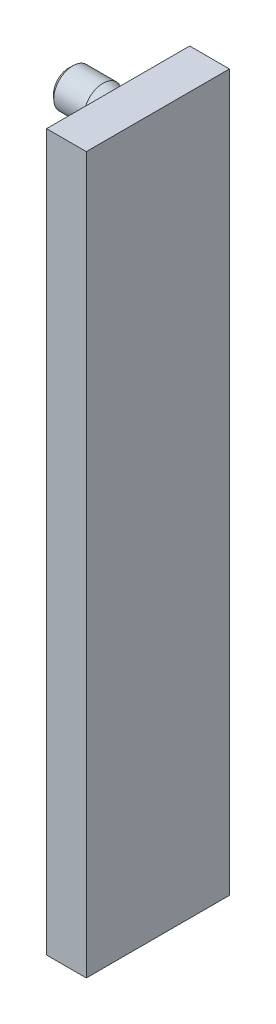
ISO-10303-21;
HEADER;
FILE_DESCRIPTION(('STEP AP214'),'2;1');
FILE_NAME('part.step','',(''),(''),'','','');
FILE_SCHEMA(('AUTOMOTIVE_DESIGN { 1 0 10303 214 1 1 1 1 }'));
ENDSEC;
DATA;
#1=APPLICATION_CONTEXT('core data for automotive mechanical design processes');
#2=APPLICATION_PROTOCOL_DEFINITION('international standard','automotive_design',2000,#1);
#3=PRODUCT_CONTEXT('',#1,'mechanical');
#4=PRODUCT('Part','Part','',(#3));
#5=PRODUCT_RELATED_PRODUCT_CATEGORY('part','',(#4));
#6=PRODUCT_DEFINITION_FORMATION('','',#4);
#7=PRODUCT_DEFINITION_CONTEXT('part definition',#1,'design');
#8=PRODUCT_DEFINITION('design','',#6,#7);
#9=PRODUCT_DEFINITION_SHAPE('','',#8);
#10=(LENGTH_UNIT() NAMED_UNIT(*) SI_UNIT(.MILLI.,.METRE.));
#11=(NAMED_UNIT(*) PLANE_ANGLE_UNIT() SI_UNIT($,.RADIAN.));
#12=(NAMED_UNIT(*) SI_UNIT($,.STERADIAN.) SOLID_ANGLE_UNIT());
#13=UNCERTAINTY_MEASURE_WITH_UNIT(LENGTH_MEASURE(1.E-05),#10,'distance_accuracy_value','');
#14=(GEOMETRIC_REPRESENTATION_CONTEXT(3) GLOBAL_UNCERTAINTY_ASSIGNED_CONTEXT((#13)) GLOBAL_UNIT_ASSIGNED_CONTEXT((#10,
#11,#12)) REPRESENTATION_CONTEXT('',''));
#15=CARTESIAN_POINT('',(0.,0.,0.));
#16=DIRECTION('',(0.,0.,1.));
#17=DIRECTION('',(1.,0.,0.));
#18=AXIS2_PLACEMENT_3D('',#15,#16,#17);
#19=CARTESIAN_POINT('',(-18.6839446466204,35.,1.9002106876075));
#20=DIRECTION('',(1.,0.,0.));
#21=DIRECTION('',(0.,1.,0.));
#22=AXIS2_PLACEMENT_3D('',#19,#20,#21);
#23=CONICAL_SURFACE('',#22,1.34162516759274,0.991977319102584);
#24=CARTESIAN_POINT('',(-18.6839446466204,35.,1.9002106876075));
#25=DIRECTION('',(1.,0.,0.));
#26=DIRECTION('',(0.,1.,0.));
#27=AXIS2_PLACEMENT_3D('',#24,#25,#26);
#28=CIRCLE('',#27,1.34162516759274);
#29=CARTESIAN_POINT('',(-18.6839446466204,36.3416251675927,1.9002106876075));
#30=VERTEX_POINT('',#29);
#31=EDGE_CURVE('E378',#30,#30,#28,.T.);
#32=ORIENTED_EDGE('',*,*,#31,.T.);
#33=EDGE_LOOP('',(#32));
#34=FACE_BOUND('',#33,.T.);
#35=CARTESIAN_POINT('',(-15.1519110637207,28.5265609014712,0.));
#36=CARTESIAN_POINT('',(-15.2544568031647,28.6901191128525,0.));
#37=CARTESIAN_POINT('',(-15.3567945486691,28.8538083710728,0.));
#38=CARTESIAN_POINT('',(-15.5609170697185,29.1815403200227,0.));
#39=CARTESIAN_POINT('',(-15.6627018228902,29.3455830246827,0.));
#40=CARTESIAN_POINT('',(-15.8657664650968,29.6744131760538,0.));
#41=CARTESIAN_POINT('',(-15.9670450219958,29.839201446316,0.));
#42=CARTESIAN_POINT('',(-16.1686855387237,30.1693317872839,0.));
#43=CARTESIAN_POINT('',(-16.2690475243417,30.3346738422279,0.));
#44=CARTESIAN_POINT('',(-16.4827361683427,30.6896316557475,0.));
#45=CARTESIAN_POINT('',(-16.5958788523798,30.8793584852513,0.));
#46=CARTESIAN_POINT('',(-16.8199167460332,31.2601620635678,0.));
#47=CARTESIAN_POINT('',(-16.9308117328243,31.45123894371,0.));
#48=CARTESIAN_POINT('',(-17.1491405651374,31.8351309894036,0.));
#49=CARTESIAN_POINT('',(-17.256577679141,32.0279442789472,0.));
#50=CARTESIAN_POINT('',(-17.4137169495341,32.3193144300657,0.));
#51=CARTESIAN_POINT('',(-17.4654235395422,32.4167887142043,0.));
#52=CARTESIAN_POINT('',(-17.5670981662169,32.6126378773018,0.));
#53=CARTESIAN_POINT('',(-17.6170662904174,32.7110127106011,0.));
#54=CARTESIAN_POINT('',(-17.7049791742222,32.8891261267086,0.));
#55=CARTESIAN_POINT('',(-17.7433321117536,32.9686627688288,0.));
#56=CARTESIAN_POINT('',(-17.818210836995,33.128597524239,0.));
#57=CARTESIAN_POINT('',(-17.8547365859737,33.2089956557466,0.));
#58=CARTESIAN_POINT('',(-17.9255155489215,33.3709076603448,0.));
#59=CARTESIAN_POINT('',(-17.9597659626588,33.4524227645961,0.));
#60=CARTESIAN_POINT('',(-18.0253036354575,33.6166444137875,0.));
#61=CARTESIAN_POINT('',(-18.0565909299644,33.6993509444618,0.));
#62=CARTESIAN_POINT('',(-18.1142915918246,33.8630449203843,0.));
#63=CARTESIAN_POINT('',(-18.1408419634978,33.9439835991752,0.));
#64=CARTESIAN_POINT('',(-18.1895109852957,34.1072073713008,0.));
#65=CARTESIAN_POINT('',(-18.211629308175,34.189492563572,0.));
#66=CARTESIAN_POINT('',(-18.2503349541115,34.3551459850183,0.));
#67=CARTESIAN_POINT('',(-18.2669367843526,34.4385107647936,0.));
#68=CARTESIAN_POINT('',(-18.2936529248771,34.6062533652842,0.));
#69=CARTESIAN_POINT('',(-18.3037705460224,34.6906306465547,0.));
#70=CARTESIAN_POINT('',(-18.3165443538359,34.8570999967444,0.));
#71=CARTESIAN_POINT('',(-18.3194404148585,34.9391732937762,0.));
#72=CARTESIAN_POINT('',(-18.3182429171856,35.1032861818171,0.));
#73=CARTESIAN_POINT('',(-18.3141477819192,35.1853257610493,0.));
#74=CARTESIAN_POINT('',(-18.2991464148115,35.3502984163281,0.));
#75=CARTESIAN_POINT('',(-18.2881155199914,35.4332199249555,0.));
#76=CARTESIAN_POINT('',(-18.259925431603,35.597965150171,0.));
#77=CARTESIAN_POINT('',(-18.2427679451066,35.6797891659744,0.));
#78=CARTESIAN_POINT('',(-18.1895405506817,35.8989115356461,0.));
#79=CARTESIAN_POINT('',(-18.1486323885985,36.0350261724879,0.));
#80=CARTESIAN_POINT('',(-18.0565914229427,36.3038052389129,0.));
#81=CARTESIAN_POINT('',(-18.0054451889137,36.4364648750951,0.));
#82=CARTESIAN_POINT('',(-17.89595613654,36.6997303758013,0.));
#83=CARTESIAN_POINT('',(-17.8375695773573,36.8303177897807,0.));
#84=CARTESIAN_POINT('',(-17.716115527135,37.0891883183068,0.));
#85=CARTESIAN_POINT('',(-17.6530504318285,37.2174725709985,0.));
#86=CARTESIAN_POINT('',(-17.5274938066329,37.4647652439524,0.));
#87=CARTESIAN_POINT('',(-17.4651921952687,37.5838707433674,0.));
#88=CARTESIAN_POINT('',(-17.3384536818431,37.8209571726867,0.));
#89=CARTESIAN_POINT('',(-17.2740164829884,37.9389379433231,0.));
#90=CARTESIAN_POINT('',(-17.144474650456,38.172361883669,0.));
#91=CARTESIAN_POINT('',(-17.0793921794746,38.2878173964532,0.));
#92=CARTESIAN_POINT('',(-16.948041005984,38.5180120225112,0.));
#93=CARTESIAN_POINT('',(-16.8817726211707,38.6327513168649,0.));
#94=CARTESIAN_POINT('',(-16.8150715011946,38.7472339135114,0.));
#95=B_SPLINE_CURVE_WITH_KNOTS('',3,(#35,#36,#37,#38,#39,#40,#41,#42,#43,#44,#45,#46,#47,#48,#49,
#50,#51,#52,#53,#54,#55,#56,#57,#58,#59,#60,#61,#62,#63,#64,#65,#66,#67,#68,#69,#70,#71,#72,#73,
#74,#75,#76,#77,#78,#79,#80,#81,#82,#83,#84,#85,#86,#87,#88,#89,#90,#91,#92,#93,#94),
.UNSPECIFIED.,.F.,.F.,(4,2,2,2,2,2,2,2,2,2,2,2,2,2,2,2,2,2,2,2,2,2,2,2,2,2,2,2,2,4),(0.,
0.579139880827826,1.15830302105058,1.73857010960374,2.31882082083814,2.98151411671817,
3.64427279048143,4.30638541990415,4.6373915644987,4.96838101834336,5.23326542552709,
5.49815544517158,5.76336564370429,6.02857266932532,6.2840186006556,6.5394833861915,
6.79427093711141,7.0489282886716,7.29500689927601,7.54114100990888,7.7918307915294,
8.04245077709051,8.46817320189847,8.89445779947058,9.32345613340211,9.75223628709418,
10.155455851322,10.5587316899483,10.9563309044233,11.3538251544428),.UNSPECIFIED.);
#96=CARTESIAN_POINT('',(-18.3067449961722,34.7332646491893,0.));
#97=VERTEX_POINT('',#96);
#98=CARTESIAN_POINT('',(-18.3067449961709,35.2667353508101,0.));
#99=VERTEX_POINT('',#98);
#100=EDGE_CURVE('E313',#97,#99,#95,.T.);
#101=ORIENTED_EDGE('',*,*,#100,.F.);
#102=CARTESIAN_POINT('',(-18.3067449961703,35.,1.9002106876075));
#103=DIRECTION('',(1.,0.,0.));
#104=DIRECTION('',(0.,1.,0.));
#105=AXIS2_PLACEMENT_3D('',#102,#103,#104);
#106=CIRCLE('',#105,1.91884038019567);
#107=EDGE_CURVE('E456',#99,#97,#106,.T.);
#108=ORIENTED_EDGE('',*,*,#107,.F.);
#109=EDGE_LOOP('',(#101,#108));
#110=FACE_BOUND('',#109,.T.);
#111=ADVANCED_FACE('F14',(#34,#110),#23,.T.);
#112=CARTESIAN_POINT('',(-18.3067449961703,35.,1.9002106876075));
#113=DIRECTION('',(1.,0.,0.));
#114=DIRECTION('',(0.,1.,0.));
#115=AXIS2_PLACEMENT_3D('',#112,#113,#114);
#116=CONICAL_SURFACE('',#115,1.91884038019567,0.760039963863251);
#117=CARTESIAN_POINT('',(-15.8429668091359,31.1864695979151,0.));
#118=CARTESIAN_POINT('',(-15.9244437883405,31.2730101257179,0.));
#119=CARTESIAN_POINT('',(-16.0056415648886,31.3598158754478,0.));
#120=CARTESIAN_POINT('',(-16.1673305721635,31.5340976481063,0.));
#121=CARTESIAN_POINT('',(-16.2478217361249,31.6215737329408,0.));
#122=CARTESIAN_POINT('',(-16.408238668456,31.7976541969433,0.));
#123=CARTESIAN_POINT('',(-16.4881611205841,31.8862616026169,0.));
#124=CARTESIAN_POINT('',(-16.646902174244,32.0644545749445,0.));
#125=CARTESIAN_POINT('',(-16.7257208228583,32.1540400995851,0.));
#126=CARTESIAN_POINT('',(-16.8862389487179,32.3393719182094,0.));
#127=CARTESIAN_POINT('',(-16.9678595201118,32.4351867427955,0.));
#128=CARTESIAN_POINT('',(-17.1290378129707,32.6285344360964,0.));
#129=CARTESIAN_POINT('',(-17.2085956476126,32.7260672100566,0.));
#130=CARTESIAN_POINT('',(-17.364794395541,32.9232069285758,0.));
#131=CARTESIAN_POINT('',(-17.4414396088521,33.0228104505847,0.));
#132=CARTESIAN_POINT('',(-17.5908182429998,33.2248944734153,0.));
#133=CARTESIAN_POINT('',(-17.6635528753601,33.3273740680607,0.));
#134=CARTESIAN_POINT('',(-17.7826268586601,33.5052016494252,0.));
#135=CARTESIAN_POINT('',(-17.8303984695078,33.5795855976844,0.));
#136=CARTESIAN_POINT('',(-17.9222269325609,33.7306698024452,0.));
#137=CARTESIAN_POINT('',(-17.9662824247,33.8073708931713,0.));
#138=CARTESIAN_POINT('',(-18.0490653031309,33.9629041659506,0.));
#139=CARTESIAN_POINT('',(-18.0878300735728,34.0417161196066,0.));
#140=CARTESIAN_POINT('',(-18.1586730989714,34.2022432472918,0.));
#141=CARTESIAN_POINT('',(-18.190756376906,34.2839561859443,0.));
#142=CARTESIAN_POINT('',(-18.2533239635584,34.4723128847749,0.));
#143=CARTESIAN_POINT('',(-18.2811927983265,34.5798850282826,0.));
#144=CARTESIAN_POINT('',(-18.3089967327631,34.7434003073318,0.));
#145=CARTESIAN_POINT('',(-18.3159315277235,34.798187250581,0.));
#146=CARTESIAN_POINT('',(-18.324840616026,34.9081757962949,0.));
#147=CARTESIAN_POINT('',(-18.326815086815,34.9633773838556,0.));
#148=CARTESIAN_POINT('',(-18.3256816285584,35.0738599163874,0.));
#149=CARTESIAN_POINT('',(-18.3225613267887,35.1291407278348,0.));
#150=CARTESIAN_POINT('',(-18.3113924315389,35.2391974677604,0.));
#151=CARTESIAN_POINT('',(-18.303343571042,35.2939733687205,0.));
#152=CARTESIAN_POINT('',(-18.2826932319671,35.4028484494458,0.));
#153=CARTESIAN_POINT('',(-18.270075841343,35.4569445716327,0.));
#154=CARTESIAN_POINT('',(-18.2408458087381,35.5640343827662,0.));
#155=CARTESIAN_POINT('',(-18.224232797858,35.6170279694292,0.));
#156=CARTESIAN_POINT('',(-18.1667947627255,35.7813574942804,0.));
#157=CARTESIAN_POINT('',(-18.1199051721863,35.8905765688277,0.));
#158=CARTESIAN_POINT('',(-18.0156353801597,36.1038986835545,0.));
#159=CARTESIAN_POINT('',(-17.9582363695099,36.2079921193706,0.));
#160=CARTESIAN_POINT('',(-17.8355616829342,36.4134254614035,0.));
#161=CARTESIAN_POINT('',(-17.7701841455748,36.5147038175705,0.));
#162=CARTESIAN_POINT('',(-17.6684658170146,36.6640273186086,0.));
#163=CARTESIAN_POINT('',(-17.6339650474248,36.7133509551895,0.));
#164=CARTESIAN_POINT('',(-17.5639258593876,36.8112544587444,0.));
#165=CARTESIAN_POINT('',(-17.5283874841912,36.8598343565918,0.));
#166=CARTESIAN_POINT('',(-17.4096284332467,37.0191562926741,0.));
#167=CARTESIAN_POINT('',(-17.3245485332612,37.1285116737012,0.));
#168=CARTESIAN_POINT('',(-17.1512190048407,37.3446893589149,0.));
#169=CARTESIAN_POINT('',(-17.0629687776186,37.4515111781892,0.));
#170=CARTESIAN_POINT('',(-16.8841368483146,37.6632835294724,0.));
#171=CARTESIAN_POINT('',(-16.7935538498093,37.7682329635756,0.));
#172=CARTESIAN_POINT('',(-16.6106853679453,37.976640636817,0.));
#173=CARTESIAN_POINT('',(-16.5183998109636,38.080098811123,0.));
#174=CARTESIAN_POINT('',(-16.2391326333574,38.38927755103,0.));
#175=CARTESIAN_POINT('',(-16.0502163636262,38.5932483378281,0.));
#176=CARTESIAN_POINT('',(-15.6692973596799,38.9981339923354,0.));
#177=CARTESIAN_POINT('',(-15.4772957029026,39.1990498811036,0.));
#178=CARTESIAN_POINT('',(-15.1148034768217,39.5743776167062,0.));
#179=CARTESIAN_POINT('',(-14.9445556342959,39.7490242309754,0.));
#180=CARTESIAN_POINT('',(-14.6028571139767,40.097170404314,0.));
#181=CARTESIAN_POINT('',(-14.4314063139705,40.2706698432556,0.));
#182=CARTESIAN_POINT('',(-14.0884730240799,40.6159275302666,0.));
#183=CARTESIAN_POINT('',(-13.9169949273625,40.7876901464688,0.));
#184=CARTESIAN_POINT('',(-13.5733724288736,41.1305054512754,0.));
#185=CARTESIAN_POINT('',(-13.4012281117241,41.3015582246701,0.));
#186=CARTESIAN_POINT('',(-13.2288350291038,41.4723583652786,0.));
#187=B_SPLINE_CURVE_WITH_KNOTS('',3,(#117,#118,#119,#120,#121,#122,#123,#124,#125,#126,#127,
#128,#129,#130,#131,#132,#133,#134,#135,#136,#137,#138,#139,#140,#141,#142,#143,#144,#145,#146,
#147,#148,#149,#150,#151,#152,#153,#154,#155,#156,#157,#158,#159,#160,#161,#162,#163,#164,#165,
#166,#167,#168,#169,#170,#171,#172,#173,#174,#175,#176,#177,#178,#179,#180,#181,#182,#183,#184,
#185,#186),.UNSPECIFIED.,.F.,.F.,(4,2,2,2,2,2,2,2,2,2,2,2,2,2,2,2,2,2,2,2,2,2,2,2,2,2,2,2,2,2,2,
2,2,2,4),(0.,0.356582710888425,0.71319875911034,1.07117159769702,1.42912912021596,
1.80670766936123,2.18426545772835,2.5612422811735,2.9381016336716,3.2032294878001,
3.46845395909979,3.73169484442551,3.99473711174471,4.32661381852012,4.49209268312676,
4.65756562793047,4.82344102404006,4.98932540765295,5.15579320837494,5.32227638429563,
5.67789990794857,6.03416624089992,6.39558226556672,6.57615103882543,6.75671229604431,
7.17227707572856,7.58792076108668,8.00380064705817,8.41969855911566,9.25368457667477,
10.0873854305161,10.8190687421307,11.5508274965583,12.2789491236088,13.0069811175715),.UNSPECIFIED.);
#188=CARTESIAN_POINT('',(-17.8004213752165,33.5337970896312,0.));
#189=VERTEX_POINT('',#188);
#190=EDGE_CURVE('E312',#189,#97,#187,.T.);
#191=ORIENTED_EDGE('',*,*,#190,.F.);
#192=CARTESIAN_POINT('',(-17.8004213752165,35.,1.9002106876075));
#193=DIRECTION('',(1.,0.,0.));
#194=DIRECTION('',(0.,1.,0.));
#195=AXIS2_PLACEMENT_3D('',#192,#193,#194);
#196=CIRCLE('',#195,2.40011492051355);
#197=CARTESIAN_POINT('',(-17.8004213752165,36.4662029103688,0.));
#198=VERTEX_POINT('',#197);
#199=EDGE_CURVE('E453',#198,#189,#196,.T.);
#200=ORIENTED_EDGE('',*,*,#199,.F.);
#201=EDGE_CURVE('E305',#99,#198,#187,.T.);
#202=ORIENTED_EDGE('',*,*,#201,.F.);
#203=ORIENTED_EDGE('',*,*,#107,.T.);
#204=EDGE_LOOP('',(#191,#200,#202,#203));
#205=FACE_BOUND('',#204,.T.);
#206=ADVANCED_FACE('F320',(#205),#116,.T.);
#207=CARTESIAN_POINT('',(-5.,35.,1.9002106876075));
#208=DIRECTION('',(1.,0.,0.));
#209=DIRECTION('',(0.,1.,0.));
#210=AXIS2_PLACEMENT_3D('',#207,#208,#209);
#211=CYLINDRICAL_SURFACE('',#210,2.40011492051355);
#212=DIRECTION('',(1.,0.,0.));
#213=VECTOR('',#212,1.);
#214=CARTESIAN_POINT('',(-5.,36.4662029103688,0.));
#215=LINE('',#214,#213);
#216=CARTESIAN_POINT('',(-14.0005746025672,36.4662029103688,0.));
#217=VERTEX_POINT('',#216);
#218=EDGE_CURVE('E35',#198,#217,#215,.T.);
#219=ORIENTED_EDGE('',*,*,#218,.F.);
#220=ORIENTED_EDGE('',*,*,#199,.T.);
#221=DIRECTION('',(1.,0.,0.));
#222=VECTOR('',#221,1.);
#223=CARTESIAN_POINT('',(-5.,33.5337970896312,0.));
#224=LINE('',#223,#222);
#225=CARTESIAN_POINT('',(-14.0005746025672,33.5337970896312,0.));
#226=VERTEX_POINT('',#225);
#227=EDGE_CURVE('E409',#226,#189,#224,.F.);
#228=ORIENTED_EDGE('',*,*,#227,.F.);
#229=CARTESIAN_POINT('',(-14.0005746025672,35.,1.9002106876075));
#230=DIRECTION('',(1.,0.,0.));
#231=DIRECTION('',(0.,1.,0.));
#232=AXIS2_PLACEMENT_3D('',#229,#230,#231);
#233=CIRCLE('',#232,2.40011492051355);
#234=EDGE_CURVE('E450',#217,#226,#233,.T.);
#235=ORIENTED_EDGE('',*,*,#234,.F.);
#236=EDGE_LOOP('',(#219,#220,#228,#235));
#237=FACE_BOUND('',#236,.T.);
#238=ADVANCED_FACE('F324',(#237),#211,.T.);
#239=CARTESIAN_POINT('',(-14.0005746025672,35.,1.9002106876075));
#240=DIRECTION('',(-1.,0.,0.));
#241=DIRECTION('',(0.,-1.,0.));
#242=AXIS2_PLACEMENT_3D('',#239,#240,#241);
#243=CONICAL_SURFACE('',#242,2.40011492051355,0.261760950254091);
#244=CARTESIAN_POINT('',(-11.3775138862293,35.,1.9002106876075));
#245=DIRECTION('',(1.,0.,0.));
#246=DIRECTION('',(0.,1.,0.));
#247=AXIS2_PLACEMENT_3D('',#244,#245,#246);
#248=CIRCLE('',#247,1.69737598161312);
#249=CARTESIAN_POINT('',(-11.3775138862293,36.6973759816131,1.9002106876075));
#250=VERTEX_POINT('',#249);
#251=EDGE_CURVE('E447',#250,#250,#248,.T.);
#252=ORIENTED_EDGE('',*,*,#251,.F.);
#253=EDGE_LOOP('',(#252));
#254=FACE_BOUND('',#253,.T.);
#255=CARTESIAN_POINT('',(-16.9489185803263,32.4377161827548,0.));
#256=CARTESIAN_POINT('',(-16.805299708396,32.4856277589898,0.));
#257=CARTESIAN_POINT('',(-16.6618174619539,32.5339535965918,0.));
#258=CARTESIAN_POINT('',(-16.375190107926,32.6316250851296,0.));
#259=CARTESIAN_POINT('',(-16.2320450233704,32.6809708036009,0.));
#260=CARTESIAN_POINT('',(-15.945840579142,32.7809838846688,0.));
#261=CARTESIAN_POINT('',(-15.8027822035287,32.8316540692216,0.));
#262=CARTESIAN_POINT('',(-15.5171990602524,32.9344652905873,0.));
#263=CARTESIAN_POINT('',(-15.3746742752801,32.9866062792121,0.));
#264=CARTESIAN_POINT('',(-15.0903534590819,33.0926896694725,0.));
#265=CARTESIAN_POINT('',(-14.948557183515,33.1466314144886,0.));
#266=CARTESIAN_POINT('',(-14.6658617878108,33.2568144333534,0.));
#267=CARTESIAN_POINT('',(-14.5249626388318,33.3130556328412,0.));
#268=CARTESIAN_POINT('',(-14.2445230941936,33.4284834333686,0.));
#269=CARTESIAN_POINT('',(-14.1049815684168,33.4876672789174,0.));
#270=CARTESIAN_POINT('',(-13.8276830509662,33.6100585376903,0.));
#271=CARTESIAN_POINT('',(-13.6899256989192,33.67326512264,0.));
#272=CARTESIAN_POINT('',(-13.5019114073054,33.7643878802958,0.));
#273=CARTESIAN_POINT('',(-13.4504591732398,33.789835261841,0.));
#274=CARTESIAN_POINT('',(-13.3480488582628,33.8417108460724,0.));
#275=CARTESIAN_POINT('',(-13.2970908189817,33.8681391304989,0.));
#276=CARTESIAN_POINT('',(-13.1448063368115,33.9492876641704,0.));
#277=CARTESIAN_POINT('',(-13.0443691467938,34.0057287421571,0.));
#278=CARTESIAN_POINT('',(-12.8970267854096,34.095193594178,0.));
#279=CARTESIAN_POINT('',(-12.8486046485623,34.1257174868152,0.));
#280=CARTESIAN_POINT('',(-12.7531191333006,34.1888121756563,0.));
#281=CARTESIAN_POINT('',(-12.7060553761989,34.2213823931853,0.));
#282=CARTESIAN_POINT('',(-12.6139846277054,34.2889782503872,0.));
#283=CARTESIAN_POINT('',(-12.5689705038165,34.3239940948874,0.));
#284=CARTESIAN_POINT('',(-12.4817133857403,34.3972933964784,0.));
#285=CARTESIAN_POINT('',(-12.4394671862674,34.4355729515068,0.));
#286=CARTESIAN_POINT('',(-12.3706621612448,34.5049212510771,0.));
#287=CARTESIAN_POINT('',(-12.3430593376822,34.5349437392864,0.));
#288=CARTESIAN_POINT('',(-12.2909410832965,34.5976912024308,0.));
#289=CARTESIAN_POINT('',(-12.266430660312,34.6304204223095,0.));
#290=CARTESIAN_POINT('',(-12.2216794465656,34.6994074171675,0.));
#291=CARTESIAN_POINT('',(-12.2015026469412,34.7357078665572,0.));
#292=CARTESIAN_POINT('',(-12.1681225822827,34.8113664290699,0.));
#293=CARTESIAN_POINT('',(-12.1548910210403,34.8507113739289,0.));
#294=CARTESIAN_POINT('',(-12.1401198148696,34.9198153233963,0.));
#295=CARTESIAN_POINT('',(-12.136315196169,34.9490870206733,0.));
#296=CARTESIAN_POINT('',(-12.1338345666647,35.007857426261,0.));
#297=CARTESIAN_POINT('',(-12.1351581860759,35.0373561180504,0.));
#298=CARTESIAN_POINT('',(-12.1427587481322,35.0955935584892,0.));
#299=CARTESIAN_POINT('',(-12.1490203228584,35.1243343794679,0.));
#300=CARTESIAN_POINT('',(-12.1657871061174,35.1805268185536,0.));
#301=CARTESIAN_POINT('',(-12.1762945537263,35.2079777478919,0.));
#302=CARTESIAN_POINT('',(-12.2085386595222,35.278477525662,0.));
#303=CARTESIAN_POINT('',(-12.2331503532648,35.3201972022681,0.));
#304=CARTESIAN_POINT('',(-12.2882616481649,35.399573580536,0.));
#305=CARTESIAN_POINT('',(-12.3187845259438,35.4372132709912,0.));
#306=CARTESIAN_POINT('',(-12.39551891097,35.5223080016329,0.));
#307=CARTESIAN_POINT('',(-12.443365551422,35.5682652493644,0.));
#308=CARTESIAN_POINT('',(-12.5431923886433,35.655510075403,0.));
#309=CARTESIAN_POINT('',(-12.595181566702,35.6967870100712,0.));
#310=CARTESIAN_POINT('',(-12.7024179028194,35.7762983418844,0.));
#311=CARTESIAN_POINT('',(-12.7576975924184,35.8144884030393,0.));
#312=CARTESIAN_POINT('',(-12.8699810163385,35.888061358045,0.));
#313=CARTESIAN_POINT('',(-12.9269826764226,35.923447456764,0.));
#314=CARTESIAN_POINT('',(-13.052068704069,35.9979044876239,0.));
#315=CARTESIAN_POINT('',(-13.1203884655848,36.0365778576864,0.));
#316=CARTESIAN_POINT('',(-13.2582754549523,36.1116425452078,0.));
#317=CARTESIAN_POINT('',(-13.3278429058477,36.1480334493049,0.));
#318=CARTESIAN_POINT('',(-13.5380001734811,36.2545488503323,0.));
#319=CARTESIAN_POINT('',(-13.6799587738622,36.3219666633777,0.));
#320=CARTESIAN_POINT('',(-13.9665614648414,36.4521837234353,0.));
#321=CARTESIAN_POINT('',(-14.1112134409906,36.5149652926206,0.));
#322=CARTESIAN_POINT('',(-14.4019392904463,36.6369726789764,0.));
#323=CARTESIAN_POINT('',(-14.5480126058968,36.6961998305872,0.));
#324=CARTESIAN_POINT('',(-14.8240709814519,36.8052321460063,0.));
#325=CARTESIAN_POINT('',(-14.9539413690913,36.8553295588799,0.));
#326=CARTESIAN_POINT('',(-15.2143243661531,36.9538693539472,0.));
#327=CARTESIAN_POINT('',(-15.3448370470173,37.0023115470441,0.));
#328=CARTESIAN_POINT('',(-15.6054210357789,37.0975020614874,0.));
#329=CARTESIAN_POINT('',(-15.7354888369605,37.1442600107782,0.));
#330=CARTESIAN_POINT('',(-15.9959998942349,37.2366487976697,0.));
#331=CARTESIAN_POINT('',(-16.1264430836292,37.2822798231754,0.));
#332=CARTESIAN_POINT('',(-16.2570407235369,37.3274583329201,0.));
#333=B_SPLINE_CURVE_WITH_KNOTS('',3,(#255,#256,#257,#258,#259,#260,#261,#262,#263,#264,#265,
#266,#267,#268,#269,#270,#271,#272,#273,#274,#275,#276,#277,#278,#279,#280,#281,#282,#283,#284,
#285,#286,#287,#288,#289,#290,#291,#292,#293,#294,#295,#296,#297,#298,#299,#300,#301,#302,#303,
#304,#305,#306,#307,#308,#309,#310,#311,#312,#313,#314,#315,#316,#317,#318,#319,#320,#321,#322,
#323,#324,#325,#326,#327,#328,#329,#330,#331,#332),.UNSPECIFIED.,.F.,.F.,(4,2,2,2,2,2,2,2,2,2,2,
2,2,2,2,2,2,2,2,2,2,2,2,2,2,2,2,2,2,2,2,2,2,2,2,2,2,2,4),(0.,0.454201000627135,
0.908432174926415,1.36372604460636,1.81900501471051,2.27411974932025,2.7292197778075,
3.18390139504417,3.63848969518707,3.81068310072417,3.98289088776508,4.32830172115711,
4.49998452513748,4.67161899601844,4.84260162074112,5.01338261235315,5.13558373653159,
5.2579802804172,5.38207585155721,5.50566183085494,5.59380081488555,5.68193344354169,
5.76979286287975,5.85769867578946,6.00216838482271,6.14721898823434,6.34574962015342,
6.54472304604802,6.74617654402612,6.94739636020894,7.18285547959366,7.4183571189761,
7.88965781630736,8.36267155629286,8.83550658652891,9.25308792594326,9.67071681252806,
10.0853624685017,10.4999385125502),.UNSPECIFIED.);
#334=EDGE_CURVE('E297',#217,#226,#333,.F.);
#335=ORIENTED_EDGE('',*,*,#334,.F.);
#336=ORIENTED_EDGE('',*,*,#234,.T.);
#337=EDGE_LOOP('',(#335,#336));
#338=FACE_BOUND('',#337,.T.);
#339=ADVANCED_FACE('F474',(#254,#338),#243,.T.);
#340=CARTESIAN_POINT('',(-11.0235946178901,35.,1.9002106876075));
#341=DIRECTION('',(1.,0.,0.));
#342=DIRECTION('',(0.,1.,0.));
#343=AXIS2_PLACEMENT_3D('',#340,#341,#342);
#344=CONICAL_SURFACE('',#343,1.8702954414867,1.37127084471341);
#345=CARTESIAN_POINT('',(-11.0235946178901,35.,1.9002106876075));
#346=DIRECTION('',(1.,0.,0.));
#347=DIRECTION('',(0.,1.,0.));
#348=AXIS2_PLACEMENT_3D('',#345,#346,#347);
#349=CIRCLE('',#348,1.8702954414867);
#350=CARTESIAN_POINT('',(-11.0235946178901,36.8702954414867,1.9002106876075));
#351=VERTEX_POINT('',#350);
#352=EDGE_CURVE('E435',#351,#351,#349,.T.);
#353=ORIENTED_EDGE('',*,*,#352,.T.);
#354=EDGE_LOOP('',(#353));
#355=FACE_BOUND('',#354,.T.);
#356=CARTESIAN_POINT('',(-10.7191820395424,32.2099457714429,0.));
#357=CARTESIAN_POINT('',(-10.7334018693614,32.2950400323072,0.));
#358=CARTESIAN_POINT('',(-10.7474262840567,32.3801669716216,0.));
#359=CARTESIAN_POINT('',(-10.7749866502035,32.5505023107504,0.));
#360=CARTESIAN_POINT('',(-10.7885225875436,32.6357107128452,0.));
#361=CARTESIAN_POINT('',(-10.828273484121,32.8916260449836,0.));
#362=CARTESIAN_POINT('',(-10.8536059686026,33.0624722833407,0.));
#363=CARTESIAN_POINT('',(-10.9005637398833,33.4035377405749,0.));
#364=CARTESIAN_POINT('',(-10.9222123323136,33.5737536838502,0.));
#365=CARTESIAN_POINT('',(-10.9602262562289,33.9147313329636,0.));
#366=CARTESIAN_POINT('',(-10.9765935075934,34.0854928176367,0.));
#367=CARTESIAN_POINT('',(-11.0018336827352,34.4284508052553,0.));
#368=CARTESIAN_POINT('',(-11.010669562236,34.6006502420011,0.));
#369=CARTESIAN_POINT('',(-11.0168839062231,34.8591291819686,0.));
#370=CARTESIAN_POINT('',(-11.0177817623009,34.9453301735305,0.));
#371=CARTESIAN_POINT('',(-11.0172030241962,35.1177225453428,0.));
#372=CARTESIAN_POINT('',(-11.0157264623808,35.2039139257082,0.));
#373=CARTESIAN_POINT('',(-11.0077980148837,35.4634017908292,0.));
#374=CARTESIAN_POINT('',(-10.9978238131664,35.6365982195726,0.));
#375=CARTESIAN_POINT('',(-10.9772868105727,35.8959206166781,0.));
#376=CARTESIAN_POINT('',(-10.9695109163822,35.98229039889,0.));
#377=CARTESIAN_POINT('',(-10.9524003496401,36.1548597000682,0.));
#378=CARTESIAN_POINT('',(-10.9430659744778,36.2410592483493,0.));
#379=CARTESIAN_POINT('',(-10.933100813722,36.3271863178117,0.));
#380=B_SPLINE_CURVE_WITH_KNOTS('',3,(#356,#357,#358,#359,#360,#361,#362,#363,#364,#365,#366,
#367,#368,#369,#370,#371,#372,#373,#374,#375,#376,#377,#378,#379),.UNSPECIFIED.,.F.,.F.,(4,2,2,
2,2,2,2,2,2,2,2,4),(0.,0.25882210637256,0.517651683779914,1.03576971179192,1.55047712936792,
2.06499722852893,2.58203371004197,2.84062016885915,3.09920310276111,3.61940692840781,
3.8795553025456,4.1396540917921),.UNSPECIFIED.);
#381=CARTESIAN_POINT('',(-11.0000000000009,34.4192490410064,0.));
#382=VERTEX_POINT('',#381);
#383=CARTESIAN_POINT('',(-11.0000000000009,35.5807509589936,0.));
#384=VERTEX_POINT('',#383);
#385=EDGE_CURVE('E275',#382,#384,#380,.T.);
#386=ORIENTED_EDGE('',*,*,#385,.F.);
#387=CARTESIAN_POINT('',(-11.0000000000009,35.,1.9002106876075));
#388=DIRECTION('',(1.,0.,0.));
#389=DIRECTION('',(0.,1.,0.));
#390=AXIS2_PLACEMENT_3D('',#387,#388,#389);
#391=CIRCLE('',#390,1.98697567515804);
#392=EDGE_CURVE('E428',#384,#382,#391,.T.);
#393=ORIENTED_EDGE('',*,*,#392,.F.);
#394=EDGE_LOOP('',(#386,#393));
#395=FACE_BOUND('',#394,.T.);
#396=ADVANCED_FACE('F476',(#355,#395),#344,.T.);
#397=CARTESIAN_POINT('',(-11.0000000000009,35.,3.88718636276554));
#398=DIRECTION('',(1.,0.,0.));
#399=DIRECTION('',(0.,1.,0.));
#400=AXIS2_PLACEMENT_3D('',#397,#398,#399);
#401=PLANE('',#400);
#402=DIRECTION('',(0.,1.,0.));
#403=VECTOR('',#402,1.);
#404=CARTESIAN_POINT('',(-11.0000000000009,35.,0.));
#405=LINE('',#404,#403);
#406=CARTESIAN_POINT('',(-11.0000000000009,33.7039228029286,0.));
#407=VERTEX_POINT('',#406);
#408=EDGE_CURVE('E411',#407,#382,#405,.T.);
#409=ORIENTED_EDGE('',*,*,#408,.F.);
#410=CARTESIAN_POINT('',(-11.0000000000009,35.,1.9002106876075));
#411=DIRECTION('',(1.,0.,0.));
#412=DIRECTION('',(0.,1.,0.));
#413=AXIS2_PLACEMENT_3D('',#410,#411,#412);
#414=CIRCLE('',#413,2.30013407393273);
#415=CARTESIAN_POINT('',(-11.0000000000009,36.2960771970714,0.));
#416=VERTEX_POINT('',#415);
#417=EDGE_CURVE('E426',#416,#407,#414,.T.);
#418=ORIENTED_EDGE('',*,*,#417,.F.);
#419=EDGE_CURVE('E413',#384,#416,#405,.T.);
#420=ORIENTED_EDGE('',*,*,#419,.F.);
#421=ORIENTED_EDGE('',*,*,#392,.T.);
#422=EDGE_LOOP('',(#409,#418,#420,#421));
#423=FACE_BOUND('',#422,.T.);
#424=ADVANCED_FACE('F483',(#423),#401,.F.);
#425=CARTESIAN_POINT('',(-11.0000000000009,35.,1.9002106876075));
#426=DIRECTION('',(1.,0.,0.));
#427=DIRECTION('',(0.,1.,0.));
#428=AXIS2_PLACEMENT_3D('',#425,#426,#427);
#429=CONICAL_SURFACE('',#428,2.30013407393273,0.785398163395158);
#430=CARTESIAN_POINT('',(-8.88399392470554,31.013586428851,0.));
#431=CARTESIAN_POINT('',(-8.96791943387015,31.106572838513,0.));
#432=CARTESIAN_POINT('',(-9.0515597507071,31.1998189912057,0.));
#433=CARTESIAN_POINT('',(-9.21811169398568,31.3869739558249,0.));
#434=CARTESIAN_POINT('',(-9.30102325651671,31.4808828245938,0.));
#435=CARTESIAN_POINT('',(-9.46614894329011,31.6697238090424,0.));
#436=CARTESIAN_POINT('',(-9.54836083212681,31.7646578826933,0.));
#437=CARTESIAN_POINT('',(-9.71163670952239,31.9555037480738,0.));
#438=CARTESIAN_POINT('',(-9.79270074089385,32.0514155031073,0.));
#439=CARTESIAN_POINT('',(-9.95192018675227,32.2427368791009,0.));
#440=CARTESIAN_POINT('',(-10.0301016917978,32.3381247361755,0.));
#441=CARTESIAN_POINT('',(-10.1846091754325,32.5303901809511,0.));
#442=CARTESIAN_POINT('',(-10.2609352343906,32.6272677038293,0.));
#443=CARTESIAN_POINT('',(-10.4110649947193,32.8228797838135,0.));
#444=CARTESIAN_POINT('',(-10.4848700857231,32.9216132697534,0.));
#445=CARTESIAN_POINT('',(-10.6290622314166,33.1215346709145,0.));
#446=CARTESIAN_POINT('',(-10.6994500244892,33.2227220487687,0.));
#447=CARTESIAN_POINT('',(-10.8218843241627,33.4079152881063,0.));
#448=CARTESIAN_POINT('',(-10.8747978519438,33.491343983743,0.));
#449=CARTESIAN_POINT('',(-10.9763413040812,33.6606701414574,0.));
#450=CARTESIAN_POINT('',(-11.0249756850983,33.74656490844,0.));
#451=CARTESIAN_POINT('',(-11.1167587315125,33.9220576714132,0.));
#452=CARTESIAN_POINT('',(-11.1598674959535,34.011677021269,0.));
#453=CARTESIAN_POINT('',(-11.2184381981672,34.1489010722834,0.));
#454=CARTESIAN_POINT('',(-11.2369737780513,34.1951928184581,0.));
#455=CARTESIAN_POINT('',(-11.271625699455,34.2887102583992,0.));
#456=CARTESIAN_POINT('',(-11.287740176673,34.3359366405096,0.));
#457=CARTESIAN_POINT('',(-11.3024541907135,34.3836200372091,0.));
#458=B_SPLINE_CURVE_WITH_KNOTS('',3,(#430,#431,#432,#433,#434,#435,#436,#437,#438,#439,#440,
#441,#442,#443,#444,#445,#446,#447,#448,#449,#450,#451,#452,#453,#454,#455,#456,#457),
.UNSPECIFIED.,.F.,.F.,(4,2,2,2,2,2,2,2,2,2,2,2,2,4),(0.,0.375780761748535,0.751594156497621,
1.12833815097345,1.5050680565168,1.87505179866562,2.2450194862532,2.61477983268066,
2.98445992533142,3.28074748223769,3.57672271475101,3.87472738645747,4.02426083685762,
4.17390884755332),.UNSPECIFIED.);
#459=CARTESIAN_POINT('',(-10.9000191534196,33.5337970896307,0.));
#460=VERTEX_POINT('',#459);
#461=EDGE_CURVE('E283',#460,#407,#458,.T.);
#462=ORIENTED_EDGE('',*,*,#461,.F.);
#463=CARTESIAN_POINT('',(-10.9000191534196,35.,1.9002106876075));
#464=DIRECTION('',(1.,0.,0.));
#465=DIRECTION('',(0.,1.,0.));
#466=AXIS2_PLACEMENT_3D('',#463,#464,#465);
#467=CIRCLE('',#466,2.40011492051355);
#468=CARTESIAN_POINT('',(-10.9000191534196,36.4662029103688,0.));
#469=VERTEX_POINT('',#468);
#470=EDGE_CURVE('E424',#469,#460,#467,.T.);
#471=ORIENTED_EDGE('',*,*,#470,.F.);
#472=CARTESIAN_POINT('',(-11.3024541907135,35.6163799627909,0.));
#473=CARTESIAN_POINT('',(-11.287740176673,35.6640633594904,0.));
#474=CARTESIAN_POINT('',(-11.271625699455,35.7112897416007,0.));
#475=CARTESIAN_POINT('',(-11.2369737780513,35.8048071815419,0.));
#476=CARTESIAN_POINT('',(-11.2184381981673,35.8510989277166,0.));
#477=CARTESIAN_POINT('',(-11.1598674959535,35.988322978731,0.));
#478=CARTESIAN_POINT('',(-11.1167587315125,36.0779423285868,0.));
#479=CARTESIAN_POINT('',(-11.0249756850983,36.25343509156,0.));
#480=CARTESIAN_POINT('',(-10.9763413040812,36.3393298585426,0.));
#481=CARTESIAN_POINT('',(-10.8747978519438,36.508656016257,0.));
#482=CARTESIAN_POINT('',(-10.8218843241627,36.5920847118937,0.));
#483=CARTESIAN_POINT('',(-10.6994500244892,36.7772779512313,0.));
#484=CARTESIAN_POINT('',(-10.6290622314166,36.8784653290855,0.));
#485=CARTESIAN_POINT('',(-10.4848700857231,37.0783867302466,0.));
#486=CARTESIAN_POINT('',(-10.4110649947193,37.1771202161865,0.));
#487=CARTESIAN_POINT('',(-10.2609352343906,37.3727322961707,0.));
#488=CARTESIAN_POINT('',(-10.1846091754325,37.4696098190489,0.));
#489=CARTESIAN_POINT('',(-10.0301016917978,37.6618752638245,0.));
#490=CARTESIAN_POINT('',(-9.95192018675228,37.7572631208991,0.));
#491=CARTESIAN_POINT('',(-9.79270074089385,37.9485844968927,0.));
#492=CARTESIAN_POINT('',(-9.7116367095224,38.0444962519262,0.));
#493=CARTESIAN_POINT('',(-9.54836083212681,38.2353421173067,0.));
#494=CARTESIAN_POINT('',(-9.46614894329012,38.3302761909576,0.));
#495=CARTESIAN_POINT('',(-9.30102325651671,38.5191171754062,0.));
#496=CARTESIAN_POINT('',(-9.21811169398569,38.6130260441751,0.));
#497=CARTESIAN_POINT('',(-9.0515597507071,38.8001810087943,0.));
#498=CARTESIAN_POINT('',(-8.96791943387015,38.893427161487,0.));
#499=CARTESIAN_POINT('',(-8.88399392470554,38.986413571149,0.));
#500=B_SPLINE_CURVE_WITH_KNOTS('',3,(#472,#473,#474,#475,#476,#477,#478,#479,#480,#481,#482,
#483,#484,#485,#486,#487,#488,#489,#490,#491,#492,#493,#494,#495,#496,#497,#498,#499),
.UNSPECIFIED.,.F.,.F.,(4,2,2,2,2,2,2,2,2,2,2,2,2,4),(0.,0.149648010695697,0.299181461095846,
0.597186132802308,0.893161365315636,1.1894489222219,1.55912901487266,1.92888936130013,
2.29885704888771,2.66884079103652,3.04557069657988,3.42231469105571,3.79812808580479,
4.17390884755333),.UNSPECIFIED.);
#501=EDGE_CURVE('E266',#416,#469,#500,.T.);
#502=ORIENTED_EDGE('',*,*,#501,.F.);
#503=ORIENTED_EDGE('',*,*,#417,.T.);
#504=EDGE_LOOP('',(#462,#471,#502,#503));
#505=FACE_BOUND('',#504,.T.);
#506=ADVANCED_FACE('F425',(#505),#429,.T.);
#507=CARTESIAN_POINT('',(-5.,35.,1.9002106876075));
#508=DIRECTION('',(1.,0.,0.));
#509=DIRECTION('',(0.,1.,0.));
#510=AXIS2_PLACEMENT_3D('',#507,#508,#509);
#511=CYLINDRICAL_SURFACE('',#510,2.40011492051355);
#512=DIRECTION('',(1.,0.,0.));
#513=VECTOR('',#512,1.);
#514=CARTESIAN_POINT('',(-5.,36.4662029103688,0.));
#515=LINE('',#514,#513);
#516=CARTESIAN_POINT('',(-5.09998084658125,36.4662029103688,0.));
#517=VERTEX_POINT('',#516);
#518=EDGE_CURVE('E43',#469,#517,#515,.T.);
#519=ORIENTED_EDGE('',*,*,#518,.F.);
#520=ORIENTED_EDGE('',*,*,#470,.T.);
#521=DIRECTION('',(1.,0.,0.));
#522=VECTOR('',#521,1.);
#523=CARTESIAN_POINT('',(-5.,33.5337970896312,0.));
#524=LINE('',#523,#522);
#525=CARTESIAN_POINT('',(-5.09998084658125,33.5337970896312,0.));
#526=VERTEX_POINT('',#525);
#527=EDGE_CURVE('E408',#526,#460,#524,.F.);
#528=ORIENTED_EDGE('',*,*,#527,.F.);
#529=CARTESIAN_POINT('',(-5.09998084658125,35.,1.9002106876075));
#530=DIRECTION('',(1.,0.,0.));
#531=DIRECTION('',(0.,1.,0.));
#532=AXIS2_PLACEMENT_3D('',#529,#530,#531);
#533=CIRCLE('',#532,2.40011492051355);
#534=EDGE_CURVE('E406',#517,#526,#533,.T.);
#535=ORIENTED_EDGE('',*,*,#534,.F.);
#536=EDGE_LOOP('',(#519,#520,#528,#535));
#537=FACE_BOUND('',#536,.T.);
#538=ADVANCED_FACE('F423',(#537),#511,.T.);
#539=CARTESIAN_POINT('',(-5.09998084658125,35.,1.9002106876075));
#540=DIRECTION('',(-1.,0.,0.));
#541=DIRECTION('',(0.,-1.,0.));
#542=AXIS2_PLACEMENT_3D('',#539,#540,#541);
#543=CONICAL_SURFACE('',#542,2.40011492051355,0.785398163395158);
#544=CARTESIAN_POINT('',(-4.69754580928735,34.3836200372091,0.));
#545=CARTESIAN_POINT('',(-4.71225982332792,34.3359366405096,0.));
#546=CARTESIAN_POINT('',(-4.72837430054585,34.2887102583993,0.));
#547=CARTESIAN_POINT('',(-4.76302622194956,34.1951928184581,0.));
#548=CARTESIAN_POINT('',(-4.78156180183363,34.1489010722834,0.));
#549=CARTESIAN_POINT('',(-4.84013250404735,34.011677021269,0.));
#550=CARTESIAN_POINT('',(-4.88324126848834,33.9220576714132,0.));
#551=CARTESIAN_POINT('',(-4.97502431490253,33.74656490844,0.));
#552=CARTESIAN_POINT('',(-5.0236586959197,33.6606701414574,0.));
#553=CARTESIAN_POINT('',(-5.12520214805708,33.491343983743,0.));
#554=CARTESIAN_POINT('',(-5.17811567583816,33.4079152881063,0.));
#555=CARTESIAN_POINT('',(-5.30054997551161,33.2227220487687,0.));
#556=CARTESIAN_POINT('',(-5.3709377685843,33.1215346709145,0.));
#557=CARTESIAN_POINT('',(-5.51512991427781,32.9216132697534,0.));
#558=CARTESIAN_POINT('',(-5.58893500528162,32.8228797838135,0.));
#559=CARTESIAN_POINT('',(-5.73906476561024,32.6272677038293,0.));
#560=CARTESIAN_POINT('',(-5.8153908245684,32.5303901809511,0.));
#561=CARTESIAN_POINT('',(-5.96989830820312,32.3381247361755,0.));
#562=CARTESIAN_POINT('',(-6.0480798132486,32.2427368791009,0.));
#563=CARTESIAN_POINT('',(-6.20729925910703,32.0514155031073,0.));
#564=CARTESIAN_POINT('',(-6.28836329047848,31.9555037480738,0.));
#565=CARTESIAN_POINT('',(-6.45163916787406,31.7646578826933,0.));
#566=CARTESIAN_POINT('',(-6.53385105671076,31.6697238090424,0.));
#567=CARTESIAN_POINT('',(-6.69897674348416,31.4808828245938,0.));
#568=CARTESIAN_POINT('',(-6.78188830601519,31.3869739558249,0.));
#569=CARTESIAN_POINT('',(-6.94844024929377,31.1998189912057,0.));
#570=CARTESIAN_POINT('',(-7.03208056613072,31.106572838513,0.));
#571=CARTESIAN_POINT('',(-7.11600607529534,31.013586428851,0.));
#572=B_SPLINE_CURVE_WITH_KNOTS('',3,(#544,#545,#546,#547,#548,#549,#550,#551,#552,#553,#554,
#555,#556,#557,#558,#559,#560,#561,#562,#563,#564,#565,#566,#567,#568,#569,#570,#571),
.UNSPECIFIED.,.F.,.F.,(4,2,2,2,2,2,2,2,2,2,2,2,2,4),(0.,0.149648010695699,0.299181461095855,
0.59718613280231,0.893161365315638,1.1894489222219,1.55912901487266,1.92888936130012,
2.29885704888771,2.66884079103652,3.04557069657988,3.4223146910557,3.7981280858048,
4.17390884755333),.UNSPECIFIED.);
#573=CARTESIAN_POINT('',(-5.,33.7039228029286,0.));
#574=VERTEX_POINT('',#573);
#575=EDGE_CURVE('E291',#574,#526,#572,.T.);
#576=ORIENTED_EDGE('',*,*,#575,.F.);
#577=CARTESIAN_POINT('',(-5.,35.,1.9002106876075));
#578=DIRECTION('',(1.,0.,0.));
#579=DIRECTION('',(0.,1.,0.));
#580=AXIS2_PLACEMENT_3D('',#577,#578,#579);
#581=CIRCLE('',#580,2.30013407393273);
#582=CARTESIAN_POINT('',(-5.,36.2960771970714,0.));
#583=VERTEX_POINT('',#582);
#584=EDGE_CURVE('E179',#583,#574,#581,.T.);
#585=ORIENTED_EDGE('',*,*,#584,.F.);
#586=CARTESIAN_POINT('',(-7.11600607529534,38.986413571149,0.));
#587=CARTESIAN_POINT('',(-7.03208056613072,38.893427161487,0.));
#588=CARTESIAN_POINT('',(-6.94844024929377,38.8001810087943,0.));
#589=CARTESIAN_POINT('',(-6.78188830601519,38.6130260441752,0.));
#590=CARTESIAN_POINT('',(-6.69897674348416,38.5191171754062,0.));
#591=CARTESIAN_POINT('',(-6.53385105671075,38.3302761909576,0.));
#592=CARTESIAN_POINT('',(-6.45163916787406,38.2353421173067,0.));
#593=CARTESIAN_POINT('',(-6.28836329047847,38.0444962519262,0.));
#594=CARTESIAN_POINT('',(-6.20729925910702,37.9485844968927,0.));
#595=CARTESIAN_POINT('',(-6.0480798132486,37.7572631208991,0.));
#596=CARTESIAN_POINT('',(-5.96989830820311,37.6618752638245,0.));
#597=CARTESIAN_POINT('',(-5.81539082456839,37.4696098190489,0.));
#598=CARTESIAN_POINT('',(-5.73906476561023,37.3727322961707,0.));
#599=CARTESIAN_POINT('',(-5.58893500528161,37.1771202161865,0.));
#600=CARTESIAN_POINT('',(-5.5151299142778,37.0783867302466,0.));
#601=CARTESIAN_POINT('',(-5.37093776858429,36.8784653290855,0.));
#602=CARTESIAN_POINT('',(-5.30054997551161,36.7772779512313,0.));
#603=CARTESIAN_POINT('',(-5.17811567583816,36.5920847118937,0.));
#604=CARTESIAN_POINT('',(-5.12520214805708,36.508656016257,0.));
#605=CARTESIAN_POINT('',(-5.0236586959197,36.3393298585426,0.));
#606=CARTESIAN_POINT('',(-4.97502431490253,36.25343509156,0.));
#607=CARTESIAN_POINT('',(-4.88324126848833,36.0779423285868,0.));
#608=CARTESIAN_POINT('',(-4.84013250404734,35.988322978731,0.));
#609=CARTESIAN_POINT('',(-4.78156180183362,35.8510989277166,0.));
#610=CARTESIAN_POINT('',(-4.76302622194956,35.8048071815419,0.));
#611=CARTESIAN_POINT('',(-4.72837430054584,35.7112897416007,0.));
#612=CARTESIAN_POINT('',(-4.71225982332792,35.6640633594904,0.));
#613=CARTESIAN_POINT('',(-4.69754580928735,35.6163799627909,0.));
#614=B_SPLINE_CURVE_WITH_KNOTS('',3,(#586,#587,#588,#589,#590,#591,#592,#593,#594,#595,#596,
#597,#598,#599,#600,#601,#602,#603,#604,#605,#606,#607,#608,#609,#610,#611,#612,#613),
.UNSPECIFIED.,.F.,.F.,(4,2,2,2,2,2,2,2,2,2,2,2,2,4),(0.,0.375780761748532,0.751594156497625,
1.12833815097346,1.50506805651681,1.87505179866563,2.24501948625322,2.6147798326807,
2.98445992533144,3.2807474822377,3.57672271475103,3.87472738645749,4.02426083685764,
4.17390884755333),.UNSPECIFIED.);
#615=EDGE_CURVE('E257',#517,#583,#614,.T.);
#616=ORIENTED_EDGE('',*,*,#615,.F.);
#617=ORIENTED_EDGE('',*,*,#534,.T.);
#618=EDGE_LOOP('',(#576,#585,#616,#617));
#619=FACE_BOUND('',#618,.T.);
#620=ADVANCED_FACE('F405',(#619),#543,.T.);
#621=CARTESIAN_POINT('',(-18.6839446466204,-35.,1.9002106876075));
#622=DIRECTION('',(1.,0.,0.));
#623=DIRECTION('',(0.,1.,0.));
#624=AXIS2_PLACEMENT_3D('',#621,#622,#623);
#625=CONICAL_SURFACE('',#624,1.34162516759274,0.991977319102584);
#626=CARTESIAN_POINT('',(-18.6839446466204,-35.,1.9002106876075));
#627=DIRECTION('',(1.,0.,0.));
#628=DIRECTION('',(0.,1.,0.));
#629=AXIS2_PLACEMENT_3D('',#626,#627,#628);
#630=CIRCLE('',#629,1.34162516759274);
#631=CARTESIAN_POINT('',(-18.6839446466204,-33.6583748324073,1.9002106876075));
#632=VERTEX_POINT('',#631);
#633=EDGE_CURVE('E613',#632,#632,#630,.T.);
#634=ORIENTED_EDGE('',*,*,#633,.T.);
#635=EDGE_LOOP('',(#634));
#636=FACE_BOUND('',#635,.T.);
#637=CARTESIAN_POINT('',(-15.1519110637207,-41.4734390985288,0.));
#638=CARTESIAN_POINT('',(-15.2544568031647,-41.3098808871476,0.));
#639=CARTESIAN_POINT('',(-15.3567945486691,-41.1461916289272,0.));
#640=CARTESIAN_POINT('',(-15.5609170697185,-40.8184596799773,0.));
#641=CARTESIAN_POINT('',(-15.6627018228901,-40.6544169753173,0.));
#642=CARTESIAN_POINT('',(-15.8657664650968,-40.3255868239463,0.));
#643=CARTESIAN_POINT('',(-15.9670450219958,-40.160798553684,0.));
#644=CARTESIAN_POINT('',(-16.1686855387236,-39.8306682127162,0.));
#645=CARTESIAN_POINT('',(-16.2690475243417,-39.6653261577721,0.));
#646=CARTESIAN_POINT('',(-16.4827361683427,-39.3103683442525,0.));
#647=CARTESIAN_POINT('',(-16.5958788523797,-39.1206415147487,0.));
#648=CARTESIAN_POINT('',(-16.8199167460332,-38.7398379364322,0.));
#649=CARTESIAN_POINT('',(-16.9308117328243,-38.54876105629,0.));
#650=CARTESIAN_POINT('',(-17.1491405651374,-38.1648690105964,0.));
#651=CARTESIAN_POINT('',(-17.256577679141,-37.9720557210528,0.));
#652=CARTESIAN_POINT('',(-17.4137169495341,-37.6806855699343,0.));
#653=CARTESIAN_POINT('',(-17.4654235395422,-37.5832112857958,0.));
#654=CARTESIAN_POINT('',(-17.5670981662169,-37.3873621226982,0.));
#655=CARTESIAN_POINT('',(-17.6170662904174,-37.2889872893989,0.));
#656=CARTESIAN_POINT('',(-17.7049791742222,-37.1108738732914,0.));
#657=CARTESIAN_POINT('',(-17.7433321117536,-37.0313372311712,0.));
#658=CARTESIAN_POINT('',(-17.818210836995,-36.871402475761,0.));
#659=CARTESIAN_POINT('',(-17.8547365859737,-36.7910043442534,0.));
#660=CARTESIAN_POINT('',(-17.9255155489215,-36.6290923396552,0.));
#661=CARTESIAN_POINT('',(-17.9597659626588,-36.5475772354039,0.));
#662=CARTESIAN_POINT('',(-18.0253036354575,-36.3833555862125,0.));
#663=CARTESIAN_POINT('',(-18.0565909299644,-36.3006490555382,0.));
#664=CARTESIAN_POINT('',(-18.1142915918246,-36.1369550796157,0.));
#665=CARTESIAN_POINT('',(-18.1408419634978,-36.0560164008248,0.));
#666=CARTESIAN_POINT('',(-18.1895109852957,-35.8927926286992,0.));
#667=CARTESIAN_POINT('',(-18.211629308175,-35.810507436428,0.));
#668=CARTESIAN_POINT('',(-18.2503349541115,-35.6448540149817,0.));
#669=CARTESIAN_POINT('',(-18.2669367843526,-35.5614892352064,0.));
#670=CARTESIAN_POINT('',(-18.2936529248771,-35.3937466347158,0.));
#671=CARTESIAN_POINT('',(-18.3037705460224,-35.3093693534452,0.));
#672=CARTESIAN_POINT('',(-18.3165443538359,-35.1429000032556,0.));
#673=CARTESIAN_POINT('',(-18.3194404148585,-35.0608267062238,0.));
#674=CARTESIAN_POINT('',(-18.3182429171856,-34.8967138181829,0.));
#675=CARTESIAN_POINT('',(-18.3141477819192,-34.8146742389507,0.));
#676=CARTESIAN_POINT('',(-18.2991464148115,-34.6497015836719,0.));
#677=CARTESIAN_POINT('',(-18.2881155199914,-34.5667800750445,0.));
#678=CARTESIAN_POINT('',(-18.259925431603,-34.402034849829,0.));
#679=CARTESIAN_POINT('',(-18.2427679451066,-34.3202108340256,0.));
#680=CARTESIAN_POINT('',(-18.1895405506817,-34.1010884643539,0.));
#681=CARTESIAN_POINT('',(-18.1486323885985,-33.9649738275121,0.));
#682=CARTESIAN_POINT('',(-18.0565914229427,-33.6961947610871,0.));
#683=CARTESIAN_POINT('',(-18.0054451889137,-33.5635351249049,0.));
#684=CARTESIAN_POINT('',(-17.8959561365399,-33.3002696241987,0.));
#685=CARTESIAN_POINT('',(-17.8375695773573,-33.1696822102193,0.));
#686=CARTESIAN_POINT('',(-17.716115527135,-32.9108116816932,0.));
#687=CARTESIAN_POINT('',(-17.6530504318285,-32.7825274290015,0.));
#688=CARTESIAN_POINT('',(-17.5274938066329,-32.5352347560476,0.));
#689=CARTESIAN_POINT('',(-17.4651921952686,-32.4161292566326,0.));
#690=CARTESIAN_POINT('',(-17.3384536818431,-32.1790428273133,0.));
#691=CARTESIAN_POINT('',(-17.2740164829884,-32.0610620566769,0.));
#692=CARTESIAN_POINT('',(-17.144474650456,-31.827638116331,0.));
#693=CARTESIAN_POINT('',(-17.0793921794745,-31.7121826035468,0.));
#694=CARTESIAN_POINT('',(-16.948041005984,-31.4819879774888,0.));
#695=CARTESIAN_POINT('',(-16.8817726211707,-31.3672486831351,0.));
#696=CARTESIAN_POINT('',(-16.8150715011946,-31.2527660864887,0.));
#697=B_SPLINE_CURVE_WITH_KNOTS('',3,(#637,#638,#639,#640,#641,#642,#643,#644,#645,#646,#647,
#648,#649,#650,#651,#652,#653,#654,#655,#656,#657,#658,#659,#660,#661,#662,#663,#664,#665,#666,
#667,#668,#669,#670,#671,#672,#673,#674,#675,#676,#677,#678,#679,#680,#681,#682,#683,#684,#685,
#686,#687,#688,#689,#690,#691,#692,#693,#694,#695,#696),.UNSPECIFIED.,.F.,.F.,(4,2,2,2,2,2,2,2,
2,2,2,2,2,2,2,2,2,2,2,2,2,2,2,2,2,2,2,2,2,4),(0.,0.579139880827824,1.15830302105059,
1.73857010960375,2.31882082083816,2.9815141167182,3.64427279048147,4.30638541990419,
4.63739156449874,4.96838101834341,5.23326542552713,5.49815544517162,5.76336564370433,
6.02857266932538,6.28401860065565,6.53948338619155,6.79427093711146,7.04892828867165,
7.29500689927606,7.54114100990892,7.79183079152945,8.04245077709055,8.46817320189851,
8.89445779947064,9.32345613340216,9.75223628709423,10.155455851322,10.5587316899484,
10.9563309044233,11.3538251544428),.UNSPECIFIED.);
#698=CARTESIAN_POINT('',(-18.3067449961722,-35.2667353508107,0.));
#699=VERTEX_POINT('',#698);
#700=CARTESIAN_POINT('',(-18.3067449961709,-34.7332646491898,0.));
#701=VERTEX_POINT('',#700);
#702=EDGE_CURVE('E249',#699,#701,#697,.T.);
#703=ORIENTED_EDGE('',*,*,#702,.F.);
#704=CARTESIAN_POINT('',(-18.3067449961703,-35.,1.9002106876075));
#705=DIRECTION('',(1.,0.,0.));
#706=DIRECTION('',(0.,1.,0.));
#707=AXIS2_PLACEMENT_3D('',#704,#705,#706);
#708=CIRCLE('',#707,1.91884038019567);
#709=EDGE_CURVE('E610',#701,#699,#708,.T.);
#710=ORIENTED_EDGE('',*,*,#709,.F.);
#711=EDGE_LOOP('',(#703,#710));
#712=FACE_BOUND('',#711,.T.);
#713=ADVANCED_FACE('F515',(#636,#712),#625,.T.);
#714=CARTESIAN_POINT('',(-18.3067449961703,-35.,1.9002106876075));
#715=DIRECTION('',(1.,0.,0.));
#716=DIRECTION('',(0.,1.,0.));
#717=AXIS2_PLACEMENT_3D('',#714,#715,#716);
#718=CONICAL_SURFACE('',#717,1.91884038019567,0.760039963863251);
#719=CARTESIAN_POINT('',(-15.8429668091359,-38.8135304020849,0.));
#720=CARTESIAN_POINT('',(-15.9244437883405,-38.7269898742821,0.));
#721=CARTESIAN_POINT('',(-16.0056415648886,-38.6401841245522,0.));
#722=CARTESIAN_POINT('',(-16.1673305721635,-38.4659023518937,0.));
#723=CARTESIAN_POINT('',(-16.2478217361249,-38.3784262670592,0.));
#724=CARTESIAN_POINT('',(-16.408238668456,-38.2023458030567,0.));
#725=CARTESIAN_POINT('',(-16.4881611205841,-38.1137383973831,0.));
#726=CARTESIAN_POINT('',(-16.646902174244,-37.9355454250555,0.));
#727=CARTESIAN_POINT('',(-16.7257208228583,-37.8459599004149,0.));
#728=CARTESIAN_POINT('',(-16.8862389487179,-37.6606280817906,0.));
#729=CARTESIAN_POINT('',(-16.9678595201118,-37.5648132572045,0.));
#730=CARTESIAN_POINT('',(-17.1290378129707,-37.3714655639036,0.));
#731=CARTESIAN_POINT('',(-17.2085956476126,-37.2739327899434,0.));
#732=CARTESIAN_POINT('',(-17.364794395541,-37.0767930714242,0.));
#733=CARTESIAN_POINT('',(-17.4414396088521,-36.9771895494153,0.));
#734=CARTESIAN_POINT('',(-17.5908182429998,-36.7751055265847,0.));
#735=CARTESIAN_POINT('',(-17.6635528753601,-36.6726259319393,0.));
#736=CARTESIAN_POINT('',(-17.7826268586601,-36.4947983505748,0.));
#737=CARTESIAN_POINT('',(-17.8303984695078,-36.4204144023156,0.));
#738=CARTESIAN_POINT('',(-17.9222269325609,-36.2693301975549,0.));
#739=CARTESIAN_POINT('',(-17.9662824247,-36.1926291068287,0.));
#740=CARTESIAN_POINT('',(-18.0490653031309,-36.0370958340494,0.));
#741=CARTESIAN_POINT('',(-18.0878300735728,-35.9582838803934,0.));
#742=CARTESIAN_POINT('',(-18.1586730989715,-35.7977567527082,0.));
#743=CARTESIAN_POINT('',(-18.190756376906,-35.7160438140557,0.));
#744=CARTESIAN_POINT('',(-18.2533239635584,-35.5276871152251,0.));
#745=CARTESIAN_POINT('',(-18.2811927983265,-35.4201149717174,0.));
#746=CARTESIAN_POINT('',(-18.3089967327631,-35.2565996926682,0.));
#747=CARTESIAN_POINT('',(-18.3159315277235,-35.201812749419,0.));
#748=CARTESIAN_POINT('',(-18.324840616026,-35.0918242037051,0.));
#749=CARTESIAN_POINT('',(-18.326815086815,-35.0366226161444,0.));
#750=CARTESIAN_POINT('',(-18.3256816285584,-34.9261400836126,0.));
#751=CARTESIAN_POINT('',(-18.3225613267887,-34.8708592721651,0.));
#752=CARTESIAN_POINT('',(-18.3113924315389,-34.7608025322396,0.));
#753=CARTESIAN_POINT('',(-18.303343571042,-34.7060266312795,0.));
#754=CARTESIAN_POINT('',(-18.2826932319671,-34.5971515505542,0.));
#755=CARTESIAN_POINT('',(-18.270075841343,-34.5430554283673,0.));
#756=CARTESIAN_POINT('',(-18.2408458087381,-34.4359656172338,0.));
#757=CARTESIAN_POINT('',(-18.224232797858,-34.3829720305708,0.));
#758=CARTESIAN_POINT('',(-18.1667947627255,-34.2186425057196,0.));
#759=CARTESIAN_POINT('',(-18.1199051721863,-34.1094234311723,0.));
#760=CARTESIAN_POINT('',(-18.0156353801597,-33.8961013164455,0.));
#761=CARTESIAN_POINT('',(-17.9582363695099,-33.7920078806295,0.));
#762=CARTESIAN_POINT('',(-17.8355616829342,-33.5865745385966,0.));
#763=CARTESIAN_POINT('',(-17.7701841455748,-33.4852961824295,0.));
#764=CARTESIAN_POINT('',(-17.6684658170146,-33.3359726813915,0.));
#765=CARTESIAN_POINT('',(-17.6339650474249,-33.2866490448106,0.));
#766=CARTESIAN_POINT('',(-17.5639258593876,-33.1887455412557,0.));
#767=CARTESIAN_POINT('',(-17.5283874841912,-33.1401656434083,0.));
#768=CARTESIAN_POINT('',(-17.4096284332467,-32.9808437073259,0.));
#769=CARTESIAN_POINT('',(-17.3245485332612,-32.8714883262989,0.));
#770=CARTESIAN_POINT('',(-17.1512190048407,-32.6553106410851,0.));
#771=CARTESIAN_POINT('',(-17.0629687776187,-32.5484888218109,0.));
#772=CARTESIAN_POINT('',(-16.8841368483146,-32.3367164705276,0.));
#773=CARTESIAN_POINT('',(-16.7935538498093,-32.2317670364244,0.));
#774=CARTESIAN_POINT('',(-16.6106853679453,-32.023359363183,0.));
#775=CARTESIAN_POINT('',(-16.5183998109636,-31.919901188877,0.));
#776=CARTESIAN_POINT('',(-16.2391326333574,-31.61072244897,0.));
#777=CARTESIAN_POINT('',(-16.0502163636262,-31.4067516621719,0.));
#778=CARTESIAN_POINT('',(-15.6692973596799,-31.0018660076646,0.));
#779=CARTESIAN_POINT('',(-15.4772957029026,-30.8009501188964,0.));
#780=CARTESIAN_POINT('',(-15.1148034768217,-30.4256223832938,0.));
#781=CARTESIAN_POINT('',(-14.9445556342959,-30.2509757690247,0.));
#782=CARTESIAN_POINT('',(-14.6028571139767,-29.902829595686,0.));
#783=CARTESIAN_POINT('',(-14.4314063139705,-29.7293301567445,0.));
#784=CARTESIAN_POINT('',(-14.0884730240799,-29.3840724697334,0.));
#785=CARTESIAN_POINT('',(-13.9169949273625,-29.2123098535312,0.));
#786=CARTESIAN_POINT('',(-13.5733724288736,-28.8694945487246,0.));
#787=CARTESIAN_POINT('',(-13.4012281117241,-28.6984417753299,0.));
#788=CARTESIAN_POINT('',(-13.2288350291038,-28.5276416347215,0.));
#789=B_SPLINE_CURVE_WITH_KNOTS('',3,(#719,#720,#721,#722,#723,#724,#725,#726,#727,#728,#729,
#730,#731,#732,#733,#734,#735,#736,#737,#738,#739,#740,#741,#742,#743,#744,#745,#746,#747,#748,
#749,#750,#751,#752,#753,#754,#755,#756,#757,#758,#759,#760,#761,#762,#763,#764,#765,#766,#767,
#768,#769,#770,#771,#772,#773,#774,#775,#776,#777,#778,#779,#780,#781,#782,#783,#784,#785,#786,
#787,#788),.UNSPECIFIED.,.F.,.F.,(4,2,2,2,2,2,2,2,2,2,2,2,2,2,2,2,2,2,2,2,2,2,2,2,2,2,2,2,2,2,2,
2,2,2,4),(0.,0.35658271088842,0.713198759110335,1.07117159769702,1.42912912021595,
1.80670766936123,2.18426545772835,2.56124228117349,2.9381016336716,3.2032294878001,
3.4684539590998,3.73169484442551,3.99473711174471,4.32661381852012,4.49209268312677,
4.65756562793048,4.82344102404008,4.98932540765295,5.15579320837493,5.32227638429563,
5.67789990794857,6.0341662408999,6.39558226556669,6.57615103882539,6.75671229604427,
7.17227707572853,7.58792076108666,8.00380064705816,8.41969855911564,9.25368457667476,
10.0873854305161,10.8190687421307,11.5508274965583,12.2789491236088,13.0069811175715),.UNSPECIFIED.);
#790=CARTESIAN_POINT('',(-17.8004213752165,-36.4662029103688,0.));
#791=VERTEX_POINT('',#790);
#792=EDGE_CURVE('E626',#791,#699,#789,.T.);
#793=ORIENTED_EDGE('',*,*,#792,.F.);
#794=CARTESIAN_POINT('',(-17.8004213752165,-35.,1.9002106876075));
#795=DIRECTION('',(1.,0.,0.));
#796=DIRECTION('',(0.,1.,0.));
#797=AXIS2_PLACEMENT_3D('',#794,#795,#796);
#798=CIRCLE('',#797,2.40011492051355);
#799=CARTESIAN_POINT('',(-17.8004213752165,-33.5337970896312,0.));
#800=VERTEX_POINT('',#799);
#801=EDGE_CURVE('E607',#800,#791,#798,.T.);
#802=ORIENTED_EDGE('',*,*,#801,.F.);
#803=EDGE_CURVE('E240',#701,#800,#789,.T.);
#804=ORIENTED_EDGE('',*,*,#803,.F.);
#805=ORIENTED_EDGE('',*,*,#709,.T.);
#806=EDGE_LOOP('',(#793,#802,#804,#805));
#807=FACE_BOUND('',#806,.T.);
#808=ADVANCED_FACE('F526',(#807),#718,.T.);
#809=CARTESIAN_POINT('',(-5.,-35.,1.9002106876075));
#810=DIRECTION('',(1.,0.,0.));
#811=DIRECTION('',(0.,1.,0.));
#812=AXIS2_PLACEMENT_3D('',#809,#810,#811);
#813=CYLINDRICAL_SURFACE('',#812,2.40011492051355);
#814=DIRECTION('',(1.,0.,0.));
#815=VECTOR('',#814,1.);
#816=CARTESIAN_POINT('',(-5.,-33.5337970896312,0.));
#817=LINE('',#816,#815);
#818=CARTESIAN_POINT('',(-14.0005746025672,-33.5337970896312,0.));
#819=VERTEX_POINT('',#818);
#820=EDGE_CURVE('E630',#800,#819,#817,.T.);
#821=ORIENTED_EDGE('',*,*,#820,.F.);
#822=ORIENTED_EDGE('',*,*,#801,.T.);
#823=DIRECTION('',(1.,0.,0.));
#824=VECTOR('',#823,1.);
#825=CARTESIAN_POINT('',(-5.,-36.4662029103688,0.));
#826=LINE('',#825,#824);
#827=CARTESIAN_POINT('',(-14.0005746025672,-36.4662029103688,0.));
#828=VERTEX_POINT('',#827);
#829=EDGE_CURVE('E631',#828,#791,#826,.F.);
#830=ORIENTED_EDGE('',*,*,#829,.F.);
#831=CARTESIAN_POINT('',(-14.0005746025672,-35.,1.9002106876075));
#832=DIRECTION('',(1.,0.,0.));
#833=DIRECTION('',(0.,1.,0.));
#834=AXIS2_PLACEMENT_3D('',#831,#832,#833);
#835=CIRCLE('',#834,2.40011492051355);
#836=EDGE_CURVE('E604',#819,#828,#835,.T.);
#837=ORIENTED_EDGE('',*,*,#836,.F.);
#838=EDGE_LOOP('',(#821,#822,#830,#837));
#839=FACE_BOUND('',#838,.T.);
#840=ADVANCED_FACE('F531',(#839),#813,.T.);
#841=CARTESIAN_POINT('',(-14.0005746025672,-35.,1.9002106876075));
#842=DIRECTION('',(-1.,0.,0.));
#843=DIRECTION('',(0.,-1.,0.));
#844=AXIS2_PLACEMENT_3D('',#841,#842,#843);
#845=CONICAL_SURFACE('',#844,2.40011492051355,0.261760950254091);
#846=CARTESIAN_POINT('',(-11.3775138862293,-35.,1.9002106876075));
#847=DIRECTION('',(1.,0.,0.));
#848=DIRECTION('',(0.,1.,0.));
#849=AXIS2_PLACEMENT_3D('',#846,#847,#848);
#850=CIRCLE('',#849,1.69737598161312);
#851=CARTESIAN_POINT('',(-11.3775138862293,-33.3026240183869,1.9002106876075));
#852=VERTEX_POINT('',#851);
#853=EDGE_CURVE('E601',#852,#852,#850,.T.);
#854=ORIENTED_EDGE('',*,*,#853,.F.);
#855=EDGE_LOOP('',(#854));
#856=FACE_BOUND('',#855,.T.);
#857=CARTESIAN_POINT('',(-16.9489185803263,-37.5622838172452,0.));
#858=CARTESIAN_POINT('',(-16.805299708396,-37.5143722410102,0.));
#859=CARTESIAN_POINT('',(-16.6618174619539,-37.4660464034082,0.));
#860=CARTESIAN_POINT('',(-16.375190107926,-37.3683749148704,0.));
#861=CARTESIAN_POINT('',(-16.2320450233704,-37.3190291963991,0.));
#862=CARTESIAN_POINT('',(-15.945840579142,-37.2190161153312,0.));
#863=CARTESIAN_POINT('',(-15.8027822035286,-37.1683459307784,0.));
#864=CARTESIAN_POINT('',(-15.5171990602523,-37.0655347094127,0.));
#865=CARTESIAN_POINT('',(-15.3746742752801,-37.0133937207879,0.));
#866=CARTESIAN_POINT('',(-15.0903534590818,-36.9073103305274,0.));
#867=CARTESIAN_POINT('',(-14.9485571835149,-36.8533685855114,0.));
#868=CARTESIAN_POINT('',(-14.6658617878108,-36.7431855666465,0.));
#869=CARTESIAN_POINT('',(-14.5249626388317,-36.6869443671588,0.));
#870=CARTESIAN_POINT('',(-14.2445230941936,-36.5715165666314,0.));
#871=CARTESIAN_POINT('',(-14.1049815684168,-36.5123327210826,0.));
#872=CARTESIAN_POINT('',(-13.8276830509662,-36.3899414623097,0.));
#873=CARTESIAN_POINT('',(-13.6899256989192,-36.32673487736,0.));
#874=CARTESIAN_POINT('',(-13.5019114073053,-36.2356121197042,0.));
#875=CARTESIAN_POINT('',(-13.4504591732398,-36.210164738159,0.));
#876=CARTESIAN_POINT('',(-13.3480488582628,-36.1582891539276,0.));
#877=CARTESIAN_POINT('',(-13.2970908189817,-36.1318608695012,0.));
#878=CARTESIAN_POINT('',(-13.1448063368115,-36.0507123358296,0.));
#879=CARTESIAN_POINT('',(-13.0443691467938,-35.9942712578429,0.));
#880=CARTESIAN_POINT('',(-12.8970267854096,-35.904806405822,0.));
#881=CARTESIAN_POINT('',(-12.8486046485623,-35.8742825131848,0.));
#882=CARTESIAN_POINT('',(-12.7531191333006,-35.8111878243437,0.));
#883=CARTESIAN_POINT('',(-12.7060553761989,-35.7786176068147,0.));
#884=CARTESIAN_POINT('',(-12.6139846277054,-35.7110217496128,0.));
#885=CARTESIAN_POINT('',(-12.5689705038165,-35.6760059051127,0.));
#886=CARTESIAN_POINT('',(-12.4817133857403,-35.6027066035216,0.));
#887=CARTESIAN_POINT('',(-12.4394671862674,-35.5644270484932,0.));
#888=CARTESIAN_POINT('',(-12.3706621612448,-35.4950787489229,0.));
#889=CARTESIAN_POINT('',(-12.3430593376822,-35.4650562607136,0.));
#890=CARTESIAN_POINT('',(-12.2909410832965,-35.4023087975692,0.));
#891=CARTESIAN_POINT('',(-12.266430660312,-35.3695795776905,0.));
#892=CARTESIAN_POINT('',(-12.2216794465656,-35.3005925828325,0.));
#893=CARTESIAN_POINT('',(-12.2015026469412,-35.2642921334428,0.));
#894=CARTESIAN_POINT('',(-12.1681225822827,-35.1886335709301,0.));
#895=CARTESIAN_POINT('',(-12.1548910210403,-35.1492886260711,0.));
#896=CARTESIAN_POINT('',(-12.1401198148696,-35.0801846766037,0.));
#897=CARTESIAN_POINT('',(-12.136315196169,-35.0509129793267,0.));
#898=CARTESIAN_POINT('',(-12.1338345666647,-34.992142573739,0.));
#899=CARTESIAN_POINT('',(-12.1351581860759,-34.9626438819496,0.));
#900=CARTESIAN_POINT('',(-12.1427587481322,-34.9044064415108,0.));
#901=CARTESIAN_POINT('',(-12.1490203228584,-34.8756656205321,0.));
#902=CARTESIAN_POINT('',(-12.1657871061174,-34.8194731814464,0.));
#903=CARTESIAN_POINT('',(-12.1762945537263,-34.7920222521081,0.));
#904=CARTESIAN_POINT('',(-12.2085386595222,-34.721522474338,0.));
#905=CARTESIAN_POINT('',(-12.2331503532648,-34.6798027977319,0.));
#906=CARTESIAN_POINT('',(-12.2882616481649,-34.600426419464,0.));
#907=CARTESIAN_POINT('',(-12.3187845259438,-34.5627867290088,0.));
#908=CARTESIAN_POINT('',(-12.39551891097,-34.4776919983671,0.));
#909=CARTESIAN_POINT('',(-12.443365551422,-34.4317347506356,0.));
#910=CARTESIAN_POINT('',(-12.5431923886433,-34.3444899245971,0.));
#911=CARTESIAN_POINT('',(-12.595181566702,-34.3032129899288,0.));
#912=CARTESIAN_POINT('',(-12.7024179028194,-34.2237016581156,0.));
#913=CARTESIAN_POINT('',(-12.7576975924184,-34.1855115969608,0.));
#914=CARTESIAN_POINT('',(-12.8699810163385,-34.111938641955,0.));
#915=CARTESIAN_POINT('',(-12.9269826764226,-34.076552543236,0.));
#916=CARTESIAN_POINT('',(-13.052068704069,-34.0020955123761,0.));
#917=CARTESIAN_POINT('',(-13.1203884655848,-33.9634221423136,0.));
#918=CARTESIAN_POINT('',(-13.2582754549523,-33.8883574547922,0.));
#919=CARTESIAN_POINT('',(-13.3278429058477,-33.8519665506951,0.));
#920=CARTESIAN_POINT('',(-13.5380001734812,-33.7454511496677,0.));
#921=CARTESIAN_POINT('',(-13.6799587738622,-33.6780333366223,0.));
#922=CARTESIAN_POINT('',(-13.9665614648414,-33.5478162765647,0.));
#923=CARTESIAN_POINT('',(-14.1112134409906,-33.4850347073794,0.));
#924=CARTESIAN_POINT('',(-14.4019392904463,-33.3630273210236,0.));
#925=CARTESIAN_POINT('',(-14.5480126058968,-33.3038001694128,0.));
#926=CARTESIAN_POINT('',(-14.8240709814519,-33.1947678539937,0.));
#927=CARTESIAN_POINT('',(-14.9539413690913,-33.1446704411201,0.));
#928=CARTESIAN_POINT('',(-15.2143243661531,-33.0461306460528,0.));
#929=CARTESIAN_POINT('',(-15.3448370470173,-32.9976884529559,0.));
#930=CARTESIAN_POINT('',(-15.6054210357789,-32.9024979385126,0.));
#931=CARTESIAN_POINT('',(-15.7354888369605,-32.8557399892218,0.));
#932=CARTESIAN_POINT('',(-15.9959998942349,-32.7633512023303,0.));
#933=CARTESIAN_POINT('',(-16.1264430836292,-32.7177201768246,0.));
#934=CARTESIAN_POINT('',(-16.2570407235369,-32.67254166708,0.));
#935=B_SPLINE_CURVE_WITH_KNOTS('',3,(#857,#858,#859,#860,#861,#862,#863,#864,#865,#866,#867,
#868,#869,#870,#871,#872,#873,#874,#875,#876,#877,#878,#879,#880,#881,#882,#883,#884,#885,#886,
#887,#888,#889,#890,#891,#892,#893,#894,#895,#896,#897,#898,#899,#900,#901,#902,#903,#904,#905,
#906,#907,#908,#909,#910,#911,#912,#913,#914,#915,#916,#917,#918,#919,#920,#921,#922,#923,#924,
#925,#926,#927,#928,#929,#930,#931,#932,#933,#934),.UNSPECIFIED.,.F.,.F.,(4,2,2,2,2,2,2,2,2,2,2,
2,2,2,2,2,2,2,2,2,2,2,2,2,2,2,2,2,2,2,2,2,2,2,2,2,2,2,4),(0.,0.454201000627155,
0.908432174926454,1.36372604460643,1.8190050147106,2.27411974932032,2.72921977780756,
3.1839013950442,3.63848969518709,3.81068310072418,3.98289088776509,4.32830172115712,
4.49998452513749,4.67161899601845,4.84260162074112,5.01338261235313,5.13558373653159,
5.25798028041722,5.38207585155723,5.50566183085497,5.59380081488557,5.68193344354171,
5.76979286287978,5.85769867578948,6.00216838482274,6.14721898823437,6.34574962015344,
6.54472304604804,6.74617654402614,6.94739636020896,7.18285547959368,7.41835711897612,
7.88965781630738,8.36267155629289,8.83550658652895,9.25308792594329,9.67071681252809,
10.0853624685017,10.4999385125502),.UNSPECIFIED.);
#936=EDGE_CURVE('E231',#819,#828,#935,.F.);
#937=ORIENTED_EDGE('',*,*,#936,.F.);
#938=ORIENTED_EDGE('',*,*,#836,.T.);
#939=EDGE_LOOP('',(#937,#938));
#940=FACE_BOUND('',#939,.T.);
#941=ADVANCED_FACE('F534',(#856,#940),#845,.T.);
#942=CARTESIAN_POINT('',(-11.0235946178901,-35.,1.9002106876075));
#943=DIRECTION('',(1.,0.,0.));
#944=DIRECTION('',(0.,1.,0.));
#945=AXIS2_PLACEMENT_3D('',#942,#943,#944);
#946=CONICAL_SURFACE('',#945,1.8702954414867,1.37127084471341);
#947=CARTESIAN_POINT('',(-11.0235946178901,-35.,1.9002106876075));
#948=DIRECTION('',(1.,0.,0.));
#949=DIRECTION('',(0.,1.,0.));
#950=AXIS2_PLACEMENT_3D('',#947,#948,#949);
#951=CIRCLE('',#950,1.8702954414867);
#952=CARTESIAN_POINT('',(-11.0235946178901,-33.1297045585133,1.9002106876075));
#953=VERTEX_POINT('',#952);
#954=EDGE_CURVE('E589',#953,#953,#951,.T.);
#955=ORIENTED_EDGE('',*,*,#954,.T.);
#956=EDGE_LOOP('',(#955));
#957=FACE_BOUND('',#956,.T.);
#958=CARTESIAN_POINT('',(-10.7191820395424,-37.7900542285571,0.));
#959=CARTESIAN_POINT('',(-10.7334018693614,-37.7049599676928,0.));
#960=CARTESIAN_POINT('',(-10.7474262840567,-37.6198330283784,0.));
#961=CARTESIAN_POINT('',(-10.7749866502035,-37.4494976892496,0.));
#962=CARTESIAN_POINT('',(-10.7885225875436,-37.3642892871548,0.));
#963=CARTESIAN_POINT('',(-10.828273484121,-37.1083739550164,0.));
#964=CARTESIAN_POINT('',(-10.8536059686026,-36.9375277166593,0.));
#965=CARTESIAN_POINT('',(-10.9005637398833,-36.5964622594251,0.));
#966=CARTESIAN_POINT('',(-10.9222123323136,-36.4262463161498,0.));
#967=CARTESIAN_POINT('',(-10.9602262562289,-36.0852686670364,0.));
#968=CARTESIAN_POINT('',(-10.9765935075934,-35.9145071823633,0.));
#969=CARTESIAN_POINT('',(-11.0018336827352,-35.5715491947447,0.));
#970=CARTESIAN_POINT('',(-11.010669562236,-35.3993497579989,0.));
#971=CARTESIAN_POINT('',(-11.0168839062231,-35.1408708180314,0.));
#972=CARTESIAN_POINT('',(-11.0177817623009,-35.0546698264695,0.));
#973=CARTESIAN_POINT('',(-11.0172030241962,-34.8822774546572,0.));
#974=CARTESIAN_POINT('',(-11.0157264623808,-34.7960860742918,0.));
#975=CARTESIAN_POINT('',(-11.0077980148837,-34.5365982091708,0.));
#976=CARTESIAN_POINT('',(-10.9978238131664,-34.3634017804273,0.));
#977=CARTESIAN_POINT('',(-10.9772868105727,-34.1040793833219,0.));
#978=CARTESIAN_POINT('',(-10.9695109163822,-34.01770960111,0.));
#979=CARTESIAN_POINT('',(-10.9524003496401,-33.8451402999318,0.));
#980=CARTESIAN_POINT('',(-10.9430659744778,-33.7589407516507,0.));
#981=CARTESIAN_POINT('',(-10.933100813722,-33.6728136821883,0.));
#982=B_SPLINE_CURVE_WITH_KNOTS('',3,(#958,#959,#960,#961,#962,#963,#964,#965,#966,#967,#968,
#969,#970,#971,#972,#973,#974,#975,#976,#977,#978,#979,#980,#981),.UNSPECIFIED.,.F.,.F.,(4,2,2,
2,2,2,2,2,2,2,2,4),(0.,0.25882210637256,0.517651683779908,1.03576971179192,1.55047712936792,
2.06499722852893,2.58203371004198,2.84062016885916,3.09920310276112,3.61940692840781,
3.87955530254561,4.13965409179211),.UNSPECIFIED.);
#983=CARTESIAN_POINT('',(-11.0000000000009,-35.5807509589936,0.));
#984=VERTEX_POINT('',#983);
#985=CARTESIAN_POINT('',(-11.0000000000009,-34.4192490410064,0.));
#986=VERTEX_POINT('',#985);
#987=EDGE_CURVE('E215',#984,#986,#982,.T.);
#988=ORIENTED_EDGE('',*,*,#987,.F.);
#989=CARTESIAN_POINT('',(-11.0000000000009,-35.,1.9002106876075));
#990=DIRECTION('',(1.,0.,0.));
#991=DIRECTION('',(0.,1.,0.));
#992=AXIS2_PLACEMENT_3D('',#989,#990,#991);
#993=CIRCLE('',#992,1.98697567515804);
#994=EDGE_CURVE('E584',#986,#984,#993,.T.);
#995=ORIENTED_EDGE('',*,*,#994,.F.);
#996=EDGE_LOOP('',(#988,#995));
#997=FACE_BOUND('',#996,.T.);
#998=ADVANCED_FACE('F539',(#957,#997),#946,.T.);
#999=CARTESIAN_POINT('',(-11.0000000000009,-35.,3.88718636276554));
#1000=DIRECTION('',(1.,0.,0.));
#1001=DIRECTION('',(0.,1.,0.));
#1002=AXIS2_PLACEMENT_3D('',#999,#1000,#1001);
#1003=PLANE('',#1002);
#1004=DIRECTION('',(0.,1.,0.));
#1005=VECTOR('',#1004,1.);
#1006=CARTESIAN_POINT('',(-11.0000000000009,-35.,0.));
#1007=LINE('',#1006,#1005);
#1008=CARTESIAN_POINT('',(-11.0000000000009,-36.2960771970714,0.));
#1009=VERTEX_POINT('',#1008);
#1010=EDGE_CURVE('E635',#1009,#984,#1007,.T.);
#1011=ORIENTED_EDGE('',*,*,#1010,.F.);
#1012=CARTESIAN_POINT('',(-11.0000000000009,-35.,1.9002106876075));
#1013=DIRECTION('',(1.,0.,0.));
#1014=DIRECTION('',(0.,1.,0.));
#1015=AXIS2_PLACEMENT_3D('',#1012,#1013,#1014);
#1016=CIRCLE('',#1015,2.30013407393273);
#1017=CARTESIAN_POINT('',(-11.0000000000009,-33.7039228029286,0.));
#1018=VERTEX_POINT('',#1017);
#1019=EDGE_CURVE('E582',#1018,#1009,#1016,.T.);
#1020=ORIENTED_EDGE('',*,*,#1019,.F.);
#1021=EDGE_CURVE('E637',#986,#1018,#1007,.T.);
#1022=ORIENTED_EDGE('',*,*,#1021,.F.);
#1023=ORIENTED_EDGE('',*,*,#994,.T.);
#1024=EDGE_LOOP('',(#1011,#1020,#1022,#1023));
#1025=FACE_BOUND('',#1024,.T.);
#1026=ADVANCED_FACE('F558',(#1025),#1003,.F.);
#1027=CARTESIAN_POINT('',(-11.0000000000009,-35.,1.9002106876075));
#1028=DIRECTION('',(1.,0.,0.));
#1029=DIRECTION('',(0.,1.,0.));
#1030=AXIS2_PLACEMENT_3D('',#1027,#1028,#1029);
#1031=CONICAL_SURFACE('',#1030,2.30013407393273,0.785398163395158);
#1032=CARTESIAN_POINT('',(-8.88399392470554,-38.986413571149,0.));
#1033=CARTESIAN_POINT('',(-8.96791943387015,-38.893427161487,0.));
#1034=CARTESIAN_POINT('',(-9.0515597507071,-38.8001810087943,0.));
#1035=CARTESIAN_POINT('',(-9.21811169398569,-38.6130260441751,0.));
#1036=CARTESIAN_POINT('',(-9.30102325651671,-38.5191171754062,0.));
#1037=CARTESIAN_POINT('',(-9.46614894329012,-38.3302761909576,0.));
#1038=CARTESIAN_POINT('',(-9.54836083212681,-38.2353421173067,0.));
#1039=CARTESIAN_POINT('',(-9.7116367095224,-38.0444962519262,0.));
#1040=CARTESIAN_POINT('',(-9.79270074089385,-37.9485844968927,0.));
#1041=CARTESIAN_POINT('',(-9.95192018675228,-37.7572631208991,0.));
#1042=CARTESIAN_POINT('',(-10.0301016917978,-37.6618752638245,0.));
#1043=CARTESIAN_POINT('',(-10.1846091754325,-37.4696098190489,0.));
#1044=CARTESIAN_POINT('',(-10.2609352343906,-37.3727322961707,0.));
#1045=CARTESIAN_POINT('',(-10.4110649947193,-37.1771202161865,0.));
#1046=CARTESIAN_POINT('',(-10.4848700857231,-37.0783867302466,0.));
#1047=CARTESIAN_POINT('',(-10.6290622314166,-36.8784653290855,0.));
#1048=CARTESIAN_POINT('',(-10.6994500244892,-36.7772779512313,0.));
#1049=CARTESIAN_POINT('',(-10.8218843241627,-36.5920847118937,0.));
#1050=CARTESIAN_POINT('',(-10.8747978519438,-36.508656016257,0.));
#1051=CARTESIAN_POINT('',(-10.9763413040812,-36.3393298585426,0.));
#1052=CARTESIAN_POINT('',(-11.0249756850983,-36.25343509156,0.));
#1053=CARTESIAN_POINT('',(-11.1167587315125,-36.0779423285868,0.));
#1054=CARTESIAN_POINT('',(-11.1598674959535,-35.988322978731,0.));
#1055=CARTESIAN_POINT('',(-11.2184381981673,-35.8510989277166,0.));
#1056=CARTESIAN_POINT('',(-11.2369737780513,-35.8048071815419,0.));
#1057=CARTESIAN_POINT('',(-11.271625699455,-35.7112897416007,0.));
#1058=CARTESIAN_POINT('',(-11.287740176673,-35.6640633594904,0.));
#1059=CARTESIAN_POINT('',(-11.3024541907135,-35.6163799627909,0.));
#1060=B_SPLINE_CURVE_WITH_KNOTS('',3,(#1032,#1033,#1034,#1035,#1036,#1037,#1038,#1039,#1040,
#1041,#1042,#1043,#1044,#1045,#1046,#1047,#1048,#1049,#1050,#1051,#1052,#1053,#1054,#1055,#1056,
#1057,#1058,#1059),.UNSPECIFIED.,.F.,.F.,(4,2,2,2,2,2,2,2,2,2,2,2,2,4),(0.,0.375780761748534,
0.751594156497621,1.12833815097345,1.50506805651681,1.87505179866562,2.24501948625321,
2.61477983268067,2.98445992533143,3.28074748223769,3.57672271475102,3.87472738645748,
4.02426083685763,4.17390884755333),.UNSPECIFIED.);
#1061=CARTESIAN_POINT('',(-10.9000191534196,-36.4662029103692,0.));
#1062=VERTEX_POINT('',#1061);
#1063=EDGE_CURVE('E223',#1062,#1009,#1060,.T.);
#1064=ORIENTED_EDGE('',*,*,#1063,.F.);
#1065=CARTESIAN_POINT('',(-10.9000191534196,-35.,1.9002106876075));
#1066=DIRECTION('',(1.,0.,0.));
#1067=DIRECTION('',(0.,1.,0.));
#1068=AXIS2_PLACEMENT_3D('',#1065,#1066,#1067);
#1069=CIRCLE('',#1068,2.40011492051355);
#1070=CARTESIAN_POINT('',(-10.9000191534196,-33.5337970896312,0.));
#1071=VERTEX_POINT('',#1070);
#1072=EDGE_CURVE('E577',#1071,#1062,#1069,.T.);
#1073=ORIENTED_EDGE('',*,*,#1072,.F.);
#1074=CARTESIAN_POINT('',(-11.3024541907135,-34.3836200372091,0.));
#1075=CARTESIAN_POINT('',(-11.287740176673,-34.3359366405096,0.));
#1076=CARTESIAN_POINT('',(-11.271625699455,-34.2887102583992,0.));
#1077=CARTESIAN_POINT('',(-11.2369737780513,-34.1951928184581,0.));
#1078=CARTESIAN_POINT('',(-11.2184381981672,-34.1489010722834,0.));
#1079=CARTESIAN_POINT('',(-11.1598674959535,-34.011677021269,0.));
#1080=CARTESIAN_POINT('',(-11.1167587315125,-33.9220576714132,0.));
#1081=CARTESIAN_POINT('',(-11.0249756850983,-33.74656490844,0.));
#1082=CARTESIAN_POINT('',(-10.9763413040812,-33.6606701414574,0.));
#1083=CARTESIAN_POINT('',(-10.8747978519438,-33.491343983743,0.));
#1084=CARTESIAN_POINT('',(-10.8218843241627,-33.4079152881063,0.));
#1085=CARTESIAN_POINT('',(-10.6994500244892,-33.2227220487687,0.));
#1086=CARTESIAN_POINT('',(-10.6290622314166,-33.1215346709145,0.));
#1087=CARTESIAN_POINT('',(-10.4848700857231,-32.9216132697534,0.));
#1088=CARTESIAN_POINT('',(-10.4110649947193,-32.8228797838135,0.));
#1089=CARTESIAN_POINT('',(-10.2609352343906,-32.6272677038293,0.));
#1090=CARTESIAN_POINT('',(-10.1846091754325,-32.5303901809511,0.));
#1091=CARTESIAN_POINT('',(-10.0301016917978,-32.3381247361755,0.));
#1092=CARTESIAN_POINT('',(-9.95192018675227,-32.2427368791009,0.));
#1093=CARTESIAN_POINT('',(-9.79270074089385,-32.0514155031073,0.));
#1094=CARTESIAN_POINT('',(-9.71163670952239,-31.9555037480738,0.));
#1095=CARTESIAN_POINT('',(-9.54836083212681,-31.7646578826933,0.));
#1096=CARTESIAN_POINT('',(-9.46614894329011,-31.6697238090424,0.));
#1097=CARTESIAN_POINT('',(-9.30102325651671,-31.4808828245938,0.));
#1098=CARTESIAN_POINT('',(-9.21811169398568,-31.3869739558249,0.));
#1099=CARTESIAN_POINT('',(-9.0515597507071,-31.1998189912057,0.));
#1100=CARTESIAN_POINT('',(-8.96791943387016,-31.106572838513,0.));
#1101=CARTESIAN_POINT('',(-8.88399392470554,-31.013586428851,0.));
#1102=B_SPLINE_CURVE_WITH_KNOTS('',3,(#1074,#1075,#1076,#1077,#1078,#1079,#1080,#1081,#1082,
#1083,#1084,#1085,#1086,#1087,#1088,#1089,#1090,#1091,#1092,#1093,#1094,#1095,#1096,#1097,#1098,
#1099,#1100,#1101),.UNSPECIFIED.,.F.,.F.,(4,2,2,2,2,2,2,2,2,2,2,2,2,4),(0.,0.149648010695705,
0.299181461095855,0.597186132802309,0.893161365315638,1.1894489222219,1.55912901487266,
1.92888936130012,2.29885704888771,2.66884079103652,3.04557069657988,3.4223146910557,
3.7981280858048,4.17390884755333),.UNSPECIFIED.);
#1103=EDGE_CURVE('E205',#1018,#1071,#1102,.T.);
#1104=ORIENTED_EDGE('',*,*,#1103,.F.);
#1105=ORIENTED_EDGE('',*,*,#1019,.T.);
#1106=EDGE_LOOP('',(#1064,#1073,#1104,#1105));
#1107=FACE_BOUND('',#1106,.T.);
#1108=ADVANCED_FACE('F561',(#1107),#1031,.T.);
#1109=CARTESIAN_POINT('',(-5.,-35.,1.9002106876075));
#1110=DIRECTION('',(1.,0.,0.));
#1111=DIRECTION('',(0.,1.,0.));
#1112=AXIS2_PLACEMENT_3D('',#1109,#1110,#1111);
#1113=CYLINDRICAL_SURFACE('',#1112,2.40011492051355);
#1114=DIRECTION('',(1.,0.,0.));
#1115=VECTOR('',#1114,1.);
#1116=CARTESIAN_POINT('',(-5.,-33.5337970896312,0.));
#1117=LINE('',#1116,#1115);
#1118=CARTESIAN_POINT('',(-5.09998084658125,-33.5337970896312,0.));
#1119=VERTEX_POINT('',#1118);
#1120=EDGE_CURVE('E166',#1071,#1119,#1117,.T.);
#1121=ORIENTED_EDGE('',*,*,#1120,.F.);
#1122=ORIENTED_EDGE('',*,*,#1072,.T.);
#1123=DIRECTION('',(1.,0.,0.));
#1124=VECTOR('',#1123,1.);
#1125=CARTESIAN_POINT('',(-5.,-36.4662029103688,0.));
#1126=LINE('',#1125,#1124);
#1127=CARTESIAN_POINT('',(-5.09998084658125,-36.4662029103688,0.));
#1128=VERTEX_POINT('',#1127);
#1129=EDGE_CURVE('E634',#1128,#1062,#1126,.F.);
#1130=ORIENTED_EDGE('',*,*,#1129,.F.);
#1131=CARTESIAN_POINT('',(-5.09998084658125,-35.,1.9002106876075));
#1132=DIRECTION('',(1.,0.,0.));
#1133=DIRECTION('',(0.,1.,0.));
#1134=AXIS2_PLACEMENT_3D('',#1131,#1132,#1133);
#1135=CIRCLE('',#1134,2.40011492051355);
#1136=EDGE_CURVE('E467',#1119,#1128,#1135,.T.);
#1137=ORIENTED_EDGE('',*,*,#1136,.F.);
#1138=EDGE_LOOP('',(#1121,#1122,#1130,#1137));
#1139=FACE_BOUND('',#1138,.T.);
#1140=ADVANCED_FACE('F565',(#1139),#1113,.T.);
#1141=CARTESIAN_POINT('',(-5.09998084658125,-35.,1.9002106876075));
#1142=DIRECTION('',(-1.,0.,0.));
#1143=DIRECTION('',(0.,-1.,0.));
#1144=AXIS2_PLACEMENT_3D('',#1141,#1142,#1143);
#1145=CONICAL_SURFACE('',#1144,2.40011492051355,0.785398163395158);
#1146=CARTESIAN_POINT('',(-4.69754580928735,-35.6163799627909,0.));
#1147=CARTESIAN_POINT('',(-4.71225982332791,-35.6640633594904,0.));
#1148=CARTESIAN_POINT('',(-4.72837430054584,-35.7112897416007,0.));
#1149=CARTESIAN_POINT('',(-4.76302622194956,-35.8048071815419,0.));
#1150=CARTESIAN_POINT('',(-4.78156180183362,-35.8510989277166,0.));
#1151=CARTESIAN_POINT('',(-4.84013250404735,-35.988322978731,0.));
#1152=CARTESIAN_POINT('',(-4.88324126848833,-36.0779423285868,0.));
#1153=CARTESIAN_POINT('',(-4.97502431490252,-36.25343509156,0.));
#1154=CARTESIAN_POINT('',(-5.0236586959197,-36.3393298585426,0.));
#1155=CARTESIAN_POINT('',(-5.12520214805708,-36.508656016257,0.));
#1156=CARTESIAN_POINT('',(-5.17811567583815,-36.5920847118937,0.));
#1157=CARTESIAN_POINT('',(-5.30054997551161,-36.7772779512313,0.));
#1158=CARTESIAN_POINT('',(-5.3709377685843,-36.8784653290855,0.));
#1159=CARTESIAN_POINT('',(-5.51512991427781,-37.0783867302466,0.));
#1160=CARTESIAN_POINT('',(-5.58893500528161,-37.1771202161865,0.));
#1161=CARTESIAN_POINT('',(-5.73906476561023,-37.3727322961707,0.));
#1162=CARTESIAN_POINT('',(-5.81539082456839,-37.4696098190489,0.));
#1163=CARTESIAN_POINT('',(-5.9698983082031,-37.6618752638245,0.));
#1164=CARTESIAN_POINT('',(-6.04807981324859,-37.7572631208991,0.));
#1165=CARTESIAN_POINT('',(-6.20729925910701,-37.9485844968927,0.));
#1166=CARTESIAN_POINT('',(-6.28836329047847,-38.0444962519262,0.));
#1167=CARTESIAN_POINT('',(-6.45163916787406,-38.2353421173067,0.));
#1168=CARTESIAN_POINT('',(-6.53385105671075,-38.3302761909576,0.));
#1169=CARTESIAN_POINT('',(-6.69897674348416,-38.5191171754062,0.));
#1170=CARTESIAN_POINT('',(-6.78188830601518,-38.6130260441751,0.));
#1171=CARTESIAN_POINT('',(-6.94844024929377,-38.8001810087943,0.));
#1172=CARTESIAN_POINT('',(-7.03208056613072,-38.893427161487,0.));
#1173=CARTESIAN_POINT('',(-7.11600607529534,-38.986413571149,0.));
#1174=B_SPLINE_CURVE_WITH_KNOTS('',3,(#1146,#1147,#1148,#1149,#1150,#1151,#1152,#1153,#1154,
#1155,#1156,#1157,#1158,#1159,#1160,#1161,#1162,#1163,#1164,#1165,#1166,#1167,#1168,#1169,#1170,
#1171,#1172,#1173),.UNSPECIFIED.,.F.,.F.,(4,2,2,2,2,2,2,2,2,2,2,2,2,4),(0.,0.149648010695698,
0.299181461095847,0.597186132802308,0.89316136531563,1.1894489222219,1.55912901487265,
1.92888936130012,2.2988570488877,2.66884079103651,3.04557069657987,3.4223146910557,
3.7981280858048,4.17390884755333),.UNSPECIFIED.);
#1175=CARTESIAN_POINT('',(-5.,-36.2960771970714,0.));
#1176=VERTEX_POINT('',#1175);
#1177=EDGE_CURVE('E9',#1176,#1128,#1174,.T.);
#1178=ORIENTED_EDGE('',*,*,#1177,.F.);
#1179=CARTESIAN_POINT('',(-5.,-35.,1.9002106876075));
#1180=DIRECTION('',(1.,0.,0.));
#1181=DIRECTION('',(0.,1.,0.));
#1182=AXIS2_PLACEMENT_3D('',#1179,#1180,#1181);
#1183=CIRCLE('',#1182,2.30013407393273);
#1184=CARTESIAN_POINT('',(-5.,-33.7039228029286,0.));
#1185=VERTEX_POINT('',#1184);
#1186=EDGE_CURVE('E171',#1176,#1185,#1183,.F.);
#1187=ORIENTED_EDGE('',*,*,#1186,.T.);
#1188=CARTESIAN_POINT('',(-7.11600607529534,-31.013586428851,0.));
#1189=CARTESIAN_POINT('',(-7.03208056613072,-31.106572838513,0.));
#1190=CARTESIAN_POINT('',(-6.94844024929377,-31.1998189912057,0.));
#1191=CARTESIAN_POINT('',(-6.78188830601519,-31.3869739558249,0.));
#1192=CARTESIAN_POINT('',(-6.69897674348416,-31.4808828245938,0.));
#1193=CARTESIAN_POINT('',(-6.53385105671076,-31.6697238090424,0.));
#1194=CARTESIAN_POINT('',(-6.45163916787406,-31.7646578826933,0.));
#1195=CARTESIAN_POINT('',(-6.28836329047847,-31.9555037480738,0.));
#1196=CARTESIAN_POINT('',(-6.20729925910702,-32.0514155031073,0.));
#1197=CARTESIAN_POINT('',(-6.0480798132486,-32.2427368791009,0.));
#1198=CARTESIAN_POINT('',(-5.96989830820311,-32.3381247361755,0.));
#1199=CARTESIAN_POINT('',(-5.8153908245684,-32.5303901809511,0.));
#1200=CARTESIAN_POINT('',(-5.73906476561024,-32.6272677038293,0.));
#1201=CARTESIAN_POINT('',(-5.58893500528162,-32.8228797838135,0.));
#1202=CARTESIAN_POINT('',(-5.51512991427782,-32.9216132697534,0.));
#1203=CARTESIAN_POINT('',(-5.37093776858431,-33.1215346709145,0.));
#1204=CARTESIAN_POINT('',(-5.30054997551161,-33.2227220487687,0.));
#1205=CARTESIAN_POINT('',(-5.17811567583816,-33.4079152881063,0.));
#1206=CARTESIAN_POINT('',(-5.12520214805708,-33.491343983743,0.));
#1207=CARTESIAN_POINT('',(-5.0236586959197,-33.6606701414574,0.));
#1208=CARTESIAN_POINT('',(-4.97502431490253,-33.74656490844,0.));
#1209=CARTESIAN_POINT('',(-4.88324126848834,-33.9220576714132,0.));
#1210=CARTESIAN_POINT('',(-4.84013250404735,-34.011677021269,0.));
#1211=CARTESIAN_POINT('',(-4.78156180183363,-34.1489010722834,0.));
#1212=CARTESIAN_POINT('',(-4.76302622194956,-34.1951928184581,0.));
#1213=CARTESIAN_POINT('',(-4.72837430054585,-34.2887102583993,0.));
#1214=CARTESIAN_POINT('',(-4.71225982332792,-34.3359366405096,0.));
#1215=CARTESIAN_POINT('',(-4.69754580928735,-34.3836200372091,0.));
#1216=B_SPLINE_CURVE_WITH_KNOTS('',3,(#1188,#1189,#1190,#1191,#1192,#1193,#1194,#1195,#1196,
#1197,#1198,#1199,#1200,#1201,#1202,#1203,#1204,#1205,#1206,#1207,#1208,#1209,#1210,#1211,#1212,
#1213,#1214,#1215),.UNSPECIFIED.,.F.,.F.,(4,2,2,2,2,2,2,2,2,2,2,2,2,4),(0.,0.375780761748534,
0.751594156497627,1.12833815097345,1.50506805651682,1.87505179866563,2.24501948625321,
2.61477983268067,2.98445992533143,3.2807474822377,3.57672271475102,3.87472738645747,
4.02426083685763,4.17390884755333),.UNSPECIFIED.);
#1217=EDGE_CURVE('E28',#1119,#1185,#1216,.T.);
#1218=ORIENTED_EDGE('',*,*,#1217,.F.);
#1219=ORIENTED_EDGE('',*,*,#1136,.T.);
#1220=EDGE_LOOP('',(#1178,#1187,#1218,#1219));
#1221=FACE_BOUND('',#1220,.T.);
#1222=ADVANCED_FACE('F183',(#1221),#1145,.T.);
#1223=CARTESIAN_POINT('',(-5.,45.,0.));
#1224=DIRECTION('',(1.,0.,0.));
#1225=DIRECTION('',(0.,1.,0.));
#1226=AXIS2_PLACEMENT_3D('',#1223,#1224,#1225);
#1227=PLANE('',#1226);
#1228=ORIENTED_EDGE('',*,*,#1186,.F.);
#1229=DIRECTION('',(0.,-1.,0.));
#1230=VECTOR('',#1229,1.);
#1231=CARTESIAN_POINT('',(-5.,45.,0.));
#1232=LINE('',#1231,#1230);
#1233=CARTESIAN_POINT('',(-5.,-45.,0.));
#1234=VERTEX_POINT('',#1233);
#1235=EDGE_CURVE('E181',#1176,#1234,#1232,.T.);
#1236=ORIENTED_EDGE('',*,*,#1235,.T.);
#1237=DIRECTION('',(0.,0.,1.));
#1238=VECTOR('',#1237,1.);
#1239=CARTESIAN_POINT('',(-5.,-45.,0.));
#1240=LINE('',#1239,#1238);
#1241=CARTESIAN_POINT('',(-5.,-45.,18.001340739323));
#1242=VERTEX_POINT('',#1241);
#1243=EDGE_CURVE('E375',#1234,#1242,#1240,.T.);
#1244=ORIENTED_EDGE('',*,*,#1243,.T.);
#1245=DIRECTION('',(0.,-1.,0.));
#1246=VECTOR('',#1245,1.);
#1247=CARTESIAN_POINT('',(-5.,45.,18.001340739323));
#1248=LINE('',#1247,#1246);
#1249=CARTESIAN_POINT('',(-5.,45.,18.001340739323));
#1250=VERTEX_POINT('',#1249);
#1251=EDGE_CURVE('E395',#1250,#1242,#1248,.T.);
#1252=ORIENTED_EDGE('',*,*,#1251,.F.);
#1253=DIRECTION('',(0.,0.,1.));
#1254=VECTOR('',#1253,1.);
#1255=CARTESIAN_POINT('',(-5.,45.,0.));
#1256=LINE('',#1255,#1254);
#1257=CARTESIAN_POINT('',(-5.,45.,0.));
#1258=VERTEX_POINT('',#1257);
#1259=EDGE_CURVE('E390',#1258,#1250,#1256,.T.);
#1260=ORIENTED_EDGE('',*,*,#1259,.F.);
#1261=EDGE_CURVE('E180',#1258,#583,#1232,.T.);
#1262=ORIENTED_EDGE('',*,*,#1261,.T.);
#1263=ORIENTED_EDGE('',*,*,#584,.T.);
#1264=EDGE_CURVE('E164',#574,#1185,#1232,.T.);
#1265=ORIENTED_EDGE('',*,*,#1264,.T.);
#1266=EDGE_LOOP('',(#1228,#1236,#1244,#1252,#1260,#1262,#1263,#1265));
#1267=FACE_BOUND('',#1266,.T.);
#1268=ADVANCED_FACE('F175',(#1267),#1227,.F.);
#1269=CARTESIAN_POINT('',(0.,45.,18.001340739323));
#1270=DIRECTION('',(-1.,0.,0.));
#1271=DIRECTION('',(0.,-1.,0.));
#1272=AXIS2_PLACEMENT_3D('',#1269,#1270,#1271);
#1273=PLANE('',#1272);
#1274=DIRECTION('',(0.,0.,-1.));
#1275=VECTOR('',#1274,1.);
#1276=CARTESIAN_POINT('',(0.,-45.,18.001340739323));
#1277=LINE('',#1276,#1275);
#1278=CARTESIAN_POINT('',(0.,-45.,18.001340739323));
#1279=VERTEX_POINT('',#1278);
#1280=CARTESIAN_POINT('',(0.,-45.,0.));
#1281=VERTEX_POINT('',#1280);
#1282=EDGE_CURVE('E366',#1279,#1281,#1277,.T.);
#1283=ORIENTED_EDGE('',*,*,#1282,.T.);
#1284=DIRECTION('',(0.,-1.,0.));
#1285=VECTOR('',#1284,1.);
#1286=CARTESIAN_POINT('',(0.,45.,0.));
#1287=LINE('',#1286,#1285);
#1288=CARTESIAN_POINT('',(0.,45.,0.));
#1289=VERTEX_POINT('',#1288);
#1290=EDGE_CURVE('E185',#1289,#1281,#1287,.T.);
#1291=ORIENTED_EDGE('',*,*,#1290,.F.);
#1292=DIRECTION('',(0.,0.,-1.));
#1293=VECTOR('',#1292,1.);
#1294=CARTESIAN_POINT('',(0.,45.,18.001340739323));
#1295=LINE('',#1294,#1293);
#1296=CARTESIAN_POINT('',(0.,45.,18.001340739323));
#1297=VERTEX_POINT('',#1296);
#1298=EDGE_CURVE('E385',#1297,#1289,#1295,.T.);
#1299=ORIENTED_EDGE('',*,*,#1298,.F.);
#1300=DIRECTION('',(0.,-1.,0.));
#1301=VECTOR('',#1300,1.);
#1302=CARTESIAN_POINT('',(0.,45.,18.001340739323));
#1303=LINE('',#1302,#1301);
#1304=EDGE_CURVE('E370',#1297,#1279,#1303,.T.);
#1305=ORIENTED_EDGE('',*,*,#1304,.T.);
#1306=EDGE_LOOP('',(#1283,#1291,#1299,#1305));
#1307=FACE_BOUND('',#1306,.T.);
#1308=ADVANCED_FACE('F16',(#1307),#1273,.F.);
#1309=CARTESIAN_POINT('',(0.,45.,0.));
#1310=DIRECTION('',(0.,0.,1.));
#1311=DIRECTION('',(1.,0.,0.));
#1312=AXIS2_PLACEMENT_3D('',#1309,#1310,#1311);
#1313=PLANE('',#1312);
#1314=DIRECTION('',(-1.,0.,0.));
#1315=VECTOR('',#1314,1.);
#1316=CARTESIAN_POINT('',(0.,-45.,0.));
#1317=LINE('',#1316,#1315);
#1318=EDGE_CURVE('E372',#1281,#1234,#1317,.T.);
#1319=ORIENTED_EDGE('',*,*,#1318,.T.);
#1320=ORIENTED_EDGE('',*,*,#1235,.F.);
#1321=ORIENTED_EDGE('',*,*,#1177,.T.);
#1322=ORIENTED_EDGE('',*,*,#1129,.T.);
#1323=ORIENTED_EDGE('',*,*,#1063,.T.);
#1324=ORIENTED_EDGE('',*,*,#1010,.T.);
#1325=ORIENTED_EDGE('',*,*,#987,.T.);
#1326=ORIENTED_EDGE('',*,*,#1021,.T.);
#1327=ORIENTED_EDGE('',*,*,#1103,.T.);
#1328=ORIENTED_EDGE('',*,*,#1120,.T.);
#1329=ORIENTED_EDGE('',*,*,#1217,.T.);
#1330=ORIENTED_EDGE('',*,*,#1264,.F.);
#1331=ORIENTED_EDGE('',*,*,#575,.T.);
#1332=ORIENTED_EDGE('',*,*,#527,.T.);
#1333=ORIENTED_EDGE('',*,*,#461,.T.);
#1334=ORIENTED_EDGE('',*,*,#408,.T.);
#1335=ORIENTED_EDGE('',*,*,#385,.T.);
#1336=ORIENTED_EDGE('',*,*,#419,.T.);
#1337=ORIENTED_EDGE('',*,*,#501,.T.);
#1338=ORIENTED_EDGE('',*,*,#518,.T.);
#1339=ORIENTED_EDGE('',*,*,#615,.T.);
#1340=ORIENTED_EDGE('',*,*,#1261,.F.);
#1341=DIRECTION('',(-1.,0.,0.));
#1342=VECTOR('',#1341,1.);
#1343=CARTESIAN_POINT('',(0.,45.,0.));
#1344=LINE('',#1343,#1342);
#1345=EDGE_CURVE('E388',#1289,#1258,#1344,.T.);
#1346=ORIENTED_EDGE('',*,*,#1345,.F.);
#1347=ORIENTED_EDGE('',*,*,#1290,.T.);
#1348=EDGE_LOOP('',(#1319,#1320,#1321,#1322,#1323,#1324,#1325,#1326,#1327,#1328,#1329,#1330,
#1331,#1332,#1333,#1334,#1335,#1336,#1337,#1338,#1339,#1340,#1346,#1347));
#1349=FACE_BOUND('',#1348,.T.);
#1350=ADVANCED_FACE('F163',(#1349),#1313,.F.);
#1351=CARTESIAN_POINT('',(-5.,45.,18.001340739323));
#1352=DIRECTION('',(0.,0.,-1.));
#1353=DIRECTION('',(-1.,0.,0.));
#1354=AXIS2_PLACEMENT_3D('',#1351,#1352,#1353);
#1355=PLANE('',#1354);
#1356=DIRECTION('',(1.,0.,0.));
#1357=VECTOR('',#1356,1.);
#1358=CARTESIAN_POINT('',(-5.,-45.,18.001340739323));
#1359=LINE('',#1358,#1357);
#1360=EDGE_CURVE('E383',#1242,#1279,#1359,.T.);
#1361=ORIENTED_EDGE('',*,*,#1360,.T.);
#1362=ORIENTED_EDGE('',*,*,#1304,.F.);
#1363=DIRECTION('',(1.,0.,0.));
#1364=VECTOR('',#1363,1.);
#1365=CARTESIAN_POINT('',(-5.,45.,18.001340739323));
#1366=LINE('',#1365,#1364);
#1367=EDGE_CURVE('E392',#1250,#1297,#1366,.T.);
#1368=ORIENTED_EDGE('',*,*,#1367,.F.);
#1369=ORIENTED_EDGE('',*,*,#1251,.T.);
#1370=EDGE_LOOP('',(#1361,#1362,#1368,#1369));
#1371=FACE_BOUND('',#1370,.T.);
#1372=ADVANCED_FACE('F346',(#1371),#1355,.F.);
#1373=CARTESIAN_POINT('',(0.,45.,0.));
#1374=DIRECTION('',(0.,1.,0.));
#1375=DIRECTION('',(-1.,0.,0.));
#1376=AXIS2_PLACEMENT_3D('',#1373,#1374,#1375);
#1377=PLANE('',#1376);
#1378=ORIENTED_EDGE('',*,*,#1298,.T.);
#1379=ORIENTED_EDGE('',*,*,#1345,.T.);
#1380=ORIENTED_EDGE('',*,*,#1259,.T.);
#1381=ORIENTED_EDGE('',*,*,#1367,.T.);
#1382=EDGE_LOOP('',(#1378,#1379,#1380,#1381));
#1383=FACE_BOUND('',#1382,.T.);
#1384=ADVANCED_FACE('F342',(#1383),#1377,.T.);
#1385=CARTESIAN_POINT('',(0.,-45.,0.));
#1386=DIRECTION('',(0.,1.,0.));
#1387=DIRECTION('',(-1.,0.,0.));
#1388=AXIS2_PLACEMENT_3D('',#1385,#1386,#1387);
#1389=PLANE('',#1388);
#1390=ORIENTED_EDGE('',*,*,#1282,.F.);
#1391=ORIENTED_EDGE('',*,*,#1360,.F.);
#1392=ORIENTED_EDGE('',*,*,#1243,.F.);
#1393=ORIENTED_EDGE('',*,*,#1318,.F.);
#1394=EDGE_LOOP('',(#1390,#1391,#1392,#1393));
#1395=FACE_BOUND('',#1394,.T.);
#1396=ADVANCED_FACE('F338',(#1395),#1389,.F.);
#1397=CARTESIAN_POINT('',(-19.0007661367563,35.,1.9002106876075));
#1398=DIRECTION('',(1.,0.,0.));
#1399=DIRECTION('',(0.,1.,0.));
#1400=AXIS2_PLACEMENT_3D('',#1397,#1398,#1399);
#1401=CONICAL_SURFACE('',#1400,2.97938756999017E-13,1.45412243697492);
#1402=CARTESIAN_POINT('',(-18.9194688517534,35.,1.9002106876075));
#1403=DIRECTION('',(1.,0.,0.));
#1404=DIRECTION('',(0.,1.,0.));
#1405=AXIS2_PLACEMENT_3D('',#1402,#1403,#1404);
#1406=CIRCLE('',#1405,0.693626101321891);
#1407=CARTESIAN_POINT('',(-18.9194688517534,35.6936261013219,1.9002106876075));
#1408=VERTEX_POINT('',#1407);
#1409=EDGE_CURVE('E373',#1408,#1408,#1406,.T.);
#1410=ORIENTED_EDGE('',*,*,#1409,.F.);
#1411=EDGE_LOOP('',(#1410));
#1412=FACE_BOUND('',#1411,.T.);
#1413=CARTESIAN_POINT('',(-19.0007661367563,35.,1.9002106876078));
#1414=VERTEX_POINT('',#1413);
#1415=VERTEX_LOOP('',#1414);
#1416=FACE_BOUND('',#1415,.T.);
#1417=ADVANCED_FACE('F334',(#1412,#1416),#1401,.T.);
#1418=CARTESIAN_POINT('',(-18.9194688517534,35.,1.9002106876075));
#1419=DIRECTION('',(1.,0.,0.));
#1420=DIRECTION('',(0.,1.,0.));
#1421=AXIS2_PLACEMENT_3D('',#1418,#1419,#1420);
#1422=CONICAL_SURFACE('',#1421,0.693626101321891,1.2221777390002);
#1423=ORIENTED_EDGE('',*,*,#31,.F.);
#1424=EDGE_LOOP('',(#1423));
#1425=FACE_BOUND('',#1424,.T.);
#1426=ORIENTED_EDGE('',*,*,#1409,.T.);
#1427=EDGE_LOOP('',(#1426));
#1428=FACE_BOUND('',#1427,.T.);
#1429=ADVANCED_FACE('F330',(#1425,#1428),#1422,.T.);
#1430=CARTESIAN_POINT('',(-11.3775138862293,35.,1.9002106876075));
#1431=DIRECTION('',(-1.,0.,0.));
#1432=DIRECTION('',(0.,-1.,0.));
#1433=AXIS2_PLACEMENT_3D('',#1430,#1431,#1432);
#1434=CONICAL_SURFACE('',#1433,1.69737598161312,0.132551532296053);
#1435=CARTESIAN_POINT('',(-11.2999425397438,35.,1.9002106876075));
#1436=DIRECTION('',(1.,0.,0.));
#1437=DIRECTION('',(0.,1.,0.));
#1438=AXIS2_PLACEMENT_3D('',#1435,#1436,#1437);
#1439=CIRCLE('',#1438,1.6870331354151);
#1440=CARTESIAN_POINT('',(-11.2999425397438,36.6870331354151,1.9002106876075));
#1441=VERTEX_POINT('',#1440);
#1442=EDGE_CURVE('E444',#1441,#1441,#1439,.T.);
#1443=ORIENTED_EDGE('',*,*,#1442,.F.);
#1444=EDGE_LOOP('',(#1443));
#1445=FACE_BOUND('',#1444,.T.);
#1446=ORIENTED_EDGE('',*,*,#251,.T.);
#1447=EDGE_LOOP('',(#1446));
#1448=FACE_BOUND('',#1447,.T.);
#1449=ADVANCED_FACE('F333',(#1445,#1448),#1434,.T.);
#1450=CARTESIAN_POINT('',(-11.2999425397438,35.,1.9002106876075));
#1451=DIRECTION('',(1.,0.,0.));
#1452=DIRECTION('',(0.,1.,0.));
#1453=AXIS2_PLACEMENT_3D('',#1450,#1451,#1452);
#1454=CONICAL_SURFACE('',#1453,1.6870331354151,0.199525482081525);
#1455=CARTESIAN_POINT('',(-11.1832623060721,35.,1.9002106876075));
#1456=DIRECTION('',(1.,0.,0.));
#1457=DIRECTION('',(0.,1.,0.));
#1458=AXIS2_PLACEMENT_3D('',#1455,#1456,#1457);
#1459=CIRCLE('',#1458,1.71062775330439);
#1460=CARTESIAN_POINT('',(-11.1832623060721,36.7106277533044,1.9002106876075));
#1461=VERTEX_POINT('',#1460);
#1462=EDGE_CURVE('E441',#1461,#1461,#1459,.T.);
#1463=ORIENTED_EDGE('',*,*,#1462,.F.);
#1464=EDGE_LOOP('',(#1463));
#1465=FACE_BOUND('',#1464,.T.);
#1466=ORIENTED_EDGE('',*,*,#1442,.T.);
#1467=EDGE_LOOP('',(#1466));
#1468=FACE_BOUND('',#1467,.T.);
#1469=ADVANCED_FACE('F490',(#1465,#1468),#1454,.T.);
#1470=CARTESIAN_POINT('',(-11.1832623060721,35.,1.9002106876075));
#1471=DIRECTION('',(1.,0.,0.));
#1472=DIRECTION('',(0.,1.,0.));
#1473=AXIS2_PLACEMENT_3D('',#1470,#1471,#1472);
#1474=CONICAL_SURFACE('',#1473,1.71062775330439,0.593458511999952);
#1475=CARTESIAN_POINT('',(-11.087914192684,35.,1.9002106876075));
#1476=DIRECTION('',(1.,0.,0.));
#1477=DIRECTION('',(0.,1.,0.));
#1478=AXIS2_PLACEMENT_3D('',#1475,#1476,#1477);
#1479=CIRCLE('',#1478,1.77494732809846);
#1480=CARTESIAN_POINT('',(-11.087914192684,36.7749473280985,1.9002106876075));
#1481=VERTEX_POINT('',#1480);
#1482=EDGE_CURVE('E438',#1481,#1481,#1479,.T.);
#1483=ORIENTED_EDGE('',*,*,#1482,.F.);
#1484=EDGE_LOOP('',(#1483));
#1485=FACE_BOUND('',#1484,.T.);
#1486=ORIENTED_EDGE('',*,*,#1462,.T.);
#1487=EDGE_LOOP('',(#1486));
#1488=FACE_BOUND('',#1487,.T.);
#1489=ADVANCED_FACE('F494',(#1485,#1488),#1474,.T.);
#1490=CARTESIAN_POINT('',(-11.087914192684,35.,1.9002106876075));
#1491=DIRECTION('',(1.,0.,0.));
#1492=DIRECTION('',(0.,1.,0.));
#1493=AXIS2_PLACEMENT_3D('',#1490,#1491,#1492);
#1494=CONICAL_SURFACE('',#1493,1.77494732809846,0.977337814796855);
#1495=ORIENTED_EDGE('',*,*,#352,.F.);
#1496=EDGE_LOOP('',(#1495));
#1497=FACE_BOUND('',#1496,.T.);
#1498=ORIENTED_EDGE('',*,*,#1482,.T.);
#1499=EDGE_LOOP('',(#1498));
#1500=FACE_BOUND('',#1499,.T.);
#1501=ADVANCED_FACE('F498',(#1497,#1500),#1494,.T.);
#1502=CARTESIAN_POINT('',(-19.0007661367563,-35.,1.9002106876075));
#1503=DIRECTION('',(1.,0.,0.));
#1504=DIRECTION('',(0.,1.,0.));
#1505=AXIS2_PLACEMENT_3D('',#1502,#1503,#1504);
#1506=CONICAL_SURFACE('',#1505,2.97938756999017E-13,1.45412243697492);
#1507=CARTESIAN_POINT('',(-18.9194688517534,-35.,1.9002106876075));
#1508=DIRECTION('',(1.,0.,0.));
#1509=DIRECTION('',(0.,1.,0.));
#1510=AXIS2_PLACEMENT_3D('',#1507,#1508,#1509);
#1511=CIRCLE('',#1510,0.693626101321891);
#1512=CARTESIAN_POINT('',(-18.9194688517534,-34.3063738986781,1.9002106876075));
#1513=VERTEX_POINT('',#1512);
#1514=EDGE_CURVE('E430',#1513,#1513,#1511,.T.);
#1515=ORIENTED_EDGE('',*,*,#1514,.F.);
#1516=EDGE_LOOP('',(#1515));
#1517=FACE_BOUND('',#1516,.T.);
#1518=CARTESIAN_POINT('',(-19.0007661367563,-35.,1.9002106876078));
#1519=VERTEX_POINT('',#1518);
#1520=VERTEX_LOOP('',#1519);
#1521=FACE_BOUND('',#1520,.T.);
#1522=ADVANCED_FACE('F501',(#1517,#1521),#1506,.T.);
#1523=CARTESIAN_POINT('',(-18.9194688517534,-35.,1.9002106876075));
#1524=DIRECTION('',(1.,0.,0.));
#1525=DIRECTION('',(0.,1.,0.));
#1526=AXIS2_PLACEMENT_3D('',#1523,#1524,#1525);
#1527=CONICAL_SURFACE('',#1526,0.693626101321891,1.2221777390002);
#1528=ORIENTED_EDGE('',*,*,#633,.F.);
#1529=EDGE_LOOP('',(#1528));
#1530=FACE_BOUND('',#1529,.T.);
#1531=ORIENTED_EDGE('',*,*,#1514,.T.);
#1532=EDGE_LOOP('',(#1531));
#1533=FACE_BOUND('',#1532,.T.);
#1534=ADVANCED_FACE('F519',(#1530,#1533),#1527,.T.);
#1535=CARTESIAN_POINT('',(-11.3775138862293,-35.,1.9002106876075));
#1536=DIRECTION('',(-1.,0.,0.));
#1537=DIRECTION('',(0.,-1.,0.));
#1538=AXIS2_PLACEMENT_3D('',#1535,#1536,#1537);
#1539=CONICAL_SURFACE('',#1538,1.69737598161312,0.132551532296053);
#1540=CARTESIAN_POINT('',(-11.2999425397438,-35.,1.9002106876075));
#1541=DIRECTION('',(1.,0.,0.));
#1542=DIRECTION('',(0.,1.,0.));
#1543=AXIS2_PLACEMENT_3D('',#1540,#1541,#1542);
#1544=CIRCLE('',#1543,1.6870331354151);
#1545=CARTESIAN_POINT('',(-11.2999425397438,-33.3129668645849,1.9002106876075));
#1546=VERTEX_POINT('',#1545);
#1547=EDGE_CURVE('E598',#1546,#1546,#1544,.T.);
#1548=ORIENTED_EDGE('',*,*,#1547,.F.);
#1549=EDGE_LOOP('',(#1548));
#1550=FACE_BOUND('',#1549,.T.);
#1551=ORIENTED_EDGE('',*,*,#853,.T.);
#1552=EDGE_LOOP('',(#1551));
#1553=FACE_BOUND('',#1552,.T.);
#1554=ADVANCED_FACE('F522',(#1550,#1553),#1539,.T.);
#1555=CARTESIAN_POINT('',(-11.2999425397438,-35.,1.9002106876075));
#1556=DIRECTION('',(1.,0.,0.));
#1557=DIRECTION('',(0.,1.,0.));
#1558=AXIS2_PLACEMENT_3D('',#1555,#1556,#1557);
#1559=CONICAL_SURFACE('',#1558,1.6870331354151,0.199525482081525);
#1560=CARTESIAN_POINT('',(-11.1832623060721,-35.,1.9002106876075));
#1561=DIRECTION('',(1.,0.,0.));
#1562=DIRECTION('',(0.,1.,0.));
#1563=AXIS2_PLACEMENT_3D('',#1560,#1561,#1562);
#1564=CIRCLE('',#1563,1.71062775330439);
#1565=CARTESIAN_POINT('',(-11.1832623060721,-33.2893722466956,1.9002106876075));
#1566=VERTEX_POINT('',#1565);
#1567=EDGE_CURVE('E595',#1566,#1566,#1564,.T.);
#1568=ORIENTED_EDGE('',*,*,#1567,.F.);
#1569=EDGE_LOOP('',(#1568));
#1570=FACE_BOUND('',#1569,.T.);
#1571=ORIENTED_EDGE('',*,*,#1547,.T.);
#1572=EDGE_LOOP('',(#1571));
#1573=FACE_BOUND('',#1572,.T.);
#1574=ADVANCED_FACE('F543',(#1570,#1573),#1559,.T.);
#1575=CARTESIAN_POINT('',(-11.1832623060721,-35.,1.9002106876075));
#1576=DIRECTION('',(1.,0.,0.));
#1577=DIRECTION('',(0.,1.,0.));
#1578=AXIS2_PLACEMENT_3D('',#1575,#1576,#1577);
#1579=CONICAL_SURFACE('',#1578,1.71062775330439,0.593458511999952);
#1580=CARTESIAN_POINT('',(-11.087914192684,-35.,1.9002106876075));
#1581=DIRECTION('',(1.,0.,0.));
#1582=DIRECTION('',(0.,1.,0.));
#1583=AXIS2_PLACEMENT_3D('',#1580,#1581,#1582);
#1584=CIRCLE('',#1583,1.77494732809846);
#1585=CARTESIAN_POINT('',(-11.087914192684,-33.2250526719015,1.9002106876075));
#1586=VERTEX_POINT('',#1585);
#1587=EDGE_CURVE('E592',#1586,#1586,#1584,.T.);
#1588=ORIENTED_EDGE('',*,*,#1587,.F.);
#1589=EDGE_LOOP('',(#1588));
#1590=FACE_BOUND('',#1589,.T.);
#1591=ORIENTED_EDGE('',*,*,#1567,.T.);
#1592=EDGE_LOOP('',(#1591));
#1593=FACE_BOUND('',#1592,.T.);
#1594=ADVANCED_FACE('F547',(#1590,#1593),#1579,.T.);
#1595=CARTESIAN_POINT('',(-11.087914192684,-35.,1.9002106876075));
#1596=DIRECTION('',(1.,0.,0.));
#1597=DIRECTION('',(0.,1.,0.));
#1598=AXIS2_PLACEMENT_3D('',#1595,#1596,#1597);
#1599=CONICAL_SURFACE('',#1598,1.77494732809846,0.977337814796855);
#1600=ORIENTED_EDGE('',*,*,#954,.F.);
#1601=EDGE_LOOP('',(#1600));
#1602=FACE_BOUND('',#1601,.T.);
#1603=ORIENTED_EDGE('',*,*,#1587,.T.);
#1604=EDGE_LOOP('',(#1603));
#1605=FACE_BOUND('',#1604,.T.);
#1606=ADVANCED_FACE('F551',(#1602,#1605),#1599,.T.);
#1607=CARTESIAN_POINT('',(-19.0007661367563,-45.,0.));
#1608=DIRECTION('',(0.,0.,-1.));
#1609=DIRECTION('',(-1.,0.,0.));
#1610=AXIS2_PLACEMENT_3D('',#1607,#1608,#1609);
#1611=PLANE('',#1610);
#1612=ORIENTED_EDGE('',*,*,#702,.T.);
#1613=ORIENTED_EDGE('',*,*,#803,.T.);
#1614=ORIENTED_EDGE('',*,*,#820,.T.);
#1615=ORIENTED_EDGE('',*,*,#936,.T.);
#1616=ORIENTED_EDGE('',*,*,#829,.T.);
#1617=ORIENTED_EDGE('',*,*,#792,.T.);
#1618=EDGE_LOOP('',(#1612,#1613,#1614,#1615,#1616,#1617));
#1619=FACE_BOUND('',#1618,.T.);
#1620=ADVANCED_FACE('F197',(#1619),#1611,.T.);
#1621=ORIENTED_EDGE('',*,*,#100,.T.);
#1622=ORIENTED_EDGE('',*,*,#201,.T.);
#1623=ORIENTED_EDGE('',*,*,#218,.T.);
#1624=ORIENTED_EDGE('',*,*,#334,.T.);
#1625=ORIENTED_EDGE('',*,*,#227,.T.);
#1626=ORIENTED_EDGE('',*,*,#190,.T.);
#1627=EDGE_LOOP('',(#1621,#1622,#1623,#1624,#1625,#1626));
#1628=FACE_BOUND('',#1627,.T.);
#1629=ADVANCED_FACE('F194',(#1628),#1611,.T.);
#1630=CLOSED_SHELL('',(#111,#206,#238,#339,#396,#424,#506,#538,#620,#713,#808,#840,#941,#998,
#1026,#1108,#1140,#1222,#1268,#1308,#1350,#1372,#1384,#1396,#1417,#1429,#1449,#1469,#1489,#1501,
#1522,#1534,#1554,#1574,#1594,#1606,#1620,#1629));
#1631=MANIFOLD_SOLID_BREP('B1',#1630);
#1632=ADVANCED_BREP_SHAPE_REPRESENTATION('',(#18,#1631),#14);
#1633=SHAPE_DEFINITION_REPRESENTATION(#9,#1632);
ENDSEC;
END-ISO-10303-21;
